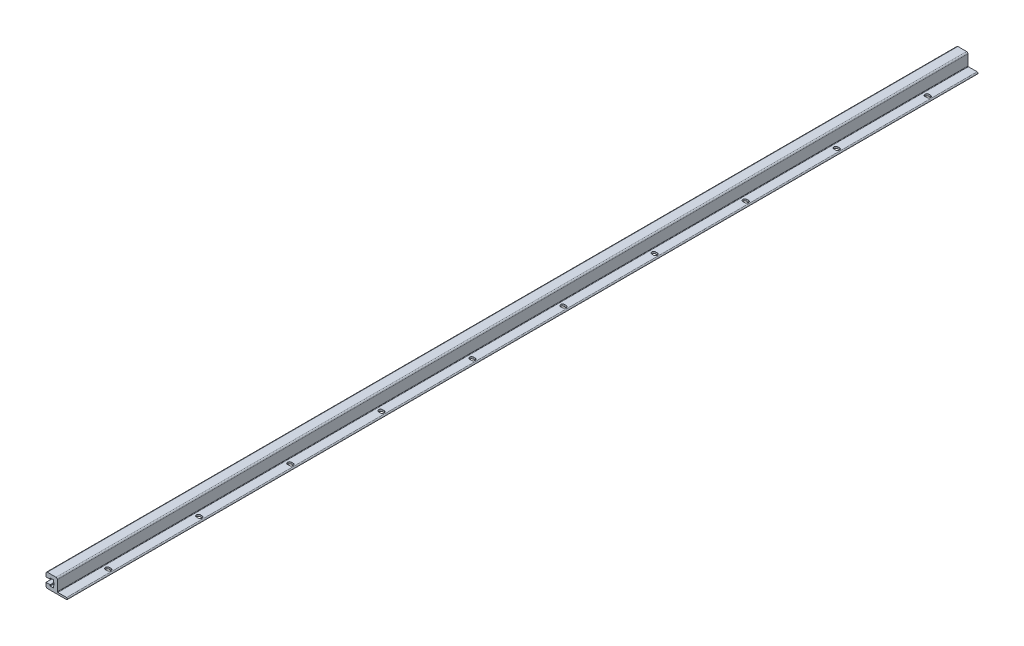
ISO-10303-21;
HEADER;
FILE_DESCRIPTION(('STEP AP214'),'2;1');
FILE_NAME('part.step','',(''),(''),'','','');
FILE_SCHEMA(('AUTOMOTIVE_DESIGN { 1 0 10303 214 1 1 1 1 }'));
ENDSEC;
DATA;
#1=APPLICATION_CONTEXT('core data for automotive mechanical design processes');
#2=APPLICATION_PROTOCOL_DEFINITION('international standard','automotive_design',2000,#1);
#3=PRODUCT_CONTEXT('',#1,'mechanical');
#4=PRODUCT('Part','Part','',(#3));
#5=PRODUCT_RELATED_PRODUCT_CATEGORY('part','',(#4));
#6=PRODUCT_DEFINITION_FORMATION('','',#4);
#7=PRODUCT_DEFINITION_CONTEXT('part definition',#1,'design');
#8=PRODUCT_DEFINITION('design','',#6,#7);
#9=PRODUCT_DEFINITION_SHAPE('','',#8);
#10=(LENGTH_UNIT() NAMED_UNIT(*) SI_UNIT(.MILLI.,.METRE.));
#11=(NAMED_UNIT(*) PLANE_ANGLE_UNIT() SI_UNIT($,.RADIAN.));
#12=(NAMED_UNIT(*) SI_UNIT($,.STERADIAN.) SOLID_ANGLE_UNIT());
#13=UNCERTAINTY_MEASURE_WITH_UNIT(LENGTH_MEASURE(1.E-05),#10,'distance_accuracy_value','');
#14=(GEOMETRIC_REPRESENTATION_CONTEXT(3) GLOBAL_UNCERTAINTY_ASSIGNED_CONTEXT((#13)) GLOBAL_UNIT_ASSIGNED_CONTEXT((#10,
#11,#12)) REPRESENTATION_CONTEXT('',''));
#15=CARTESIAN_POINT('',(0.,0.,0.));
#16=DIRECTION('',(0.,0.,1.));
#17=DIRECTION('',(1.,0.,0.));
#18=AXIS2_PLACEMENT_3D('',#15,#16,#17);
#19=CARTESIAN_POINT('',(3.69999999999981,7.75000000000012,0.));
#20=DIRECTION('',(-1.,0.,0.));
#21=DIRECTION('',(0.,0.,1.));
#22=AXIS2_PLACEMENT_3D('',#19,#20,#21);
#23=PLANE('',#22);
#24=DIRECTION('',(0.,0.,1.));
#25=VECTOR('',#24,1.);
#26=CARTESIAN_POINT('',(3.69999999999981,18.7,0.));
#27=LINE('',#26,#25);
#28=CARTESIAN_POINT('',(3.69999999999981,18.7,0.));
#29=VERTEX_POINT('',#28);
#30=CARTESIAN_POINT('',(3.69999999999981,18.7,2000.));
#31=VERTEX_POINT('',#30);
#32=EDGE_CURVE('E597',#29,#31,#27,.T.);
#33=ORIENTED_EDGE('',*,*,#32,.T.);
#34=DIRECTION('',(0.,-1.,0.));
#35=VECTOR('',#34,1.);
#36=CARTESIAN_POINT('',(3.69999999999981,7.75000000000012,2000.));
#37=LINE('',#36,#35);
#38=CARTESIAN_POINT('',(3.69999999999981,23.25,2000.));
#39=VERTEX_POINT('',#38);
#40=EDGE_CURVE('E540',#39,#31,#37,.T.);
#41=ORIENTED_EDGE('',*,*,#40,.F.);
#42=DIRECTION('',(0.,0.,1.));
#43=VECTOR('',#42,1.);
#44=CARTESIAN_POINT('',(3.69999999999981,23.25,0.));
#45=LINE('',#44,#43);
#46=CARTESIAN_POINT('',(3.69999999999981,23.25,0.));
#47=VERTEX_POINT('',#46);
#48=EDGE_CURVE('E494',#47,#39,#45,.T.);
#49=ORIENTED_EDGE('',*,*,#48,.F.);
#50=DIRECTION('',(0.,-1.,0.));
#51=VECTOR('',#50,1.);
#52=CARTESIAN_POINT('',(3.69999999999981,7.75000000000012,0.));
#53=LINE('',#52,#51);
#54=EDGE_CURVE('E428',#47,#29,#53,.T.);
#55=ORIENTED_EDGE('',*,*,#54,.T.);
#56=EDGE_LOOP('',(#33,#41,#49,#55));
#57=FACE_BOUND('',#56,.T.);
#58=ADVANCED_FACE('F14',(#57),#23,.T.);
#59=CARTESIAN_POINT('',(-9.5,28.,0.));
#60=DIRECTION('',(0.,0.,1.));
#61=DIRECTION('',(1.,0.,0.));
#62=AXIS2_PLACEMENT_3D('',#59,#60,#61);
#63=CYLINDRICAL_SURFACE('',#62,3.);
#64=CARTESIAN_POINT('',(-9.5,28.,2000.));
#65=DIRECTION('',(0.,0.,1.));
#66=DIRECTION('',(-1.,0.,0.));
#67=AXIS2_PLACEMENT_3D('',#64,#65,#66);
#68=CIRCLE('',#67,3.);
#69=CARTESIAN_POINT('',(-9.5,31.,2000.));
#70=VERTEX_POINT('',#69);
#71=CARTESIAN_POINT('',(-12.5,28.,2000.));
#72=VERTEX_POINT('',#71);
#73=EDGE_CURVE('E508',#70,#72,#68,.T.);
#74=ORIENTED_EDGE('',*,*,#73,.F.);
#75=DIRECTION('',(0.,0.,1.));
#76=VECTOR('',#75,1.);
#77=CARTESIAN_POINT('',(-9.5,31.,0.));
#78=LINE('',#77,#76);
#79=CARTESIAN_POINT('',(-9.5,31.,0.));
#80=VERTEX_POINT('',#79);
#81=EDGE_CURVE('E9',#80,#70,#78,.T.);
#82=ORIENTED_EDGE('',*,*,#81,.F.);
#83=CARTESIAN_POINT('',(-9.5,28.,0.));
#84=DIRECTION('',(0.,0.,1.));
#85=DIRECTION('',(-1.,0.,0.));
#86=AXIS2_PLACEMENT_3D('',#83,#84,#85);
#87=CIRCLE('',#86,3.);
#88=CARTESIAN_POINT('',(-12.5,28.,0.));
#89=VERTEX_POINT('',#88);
#90=EDGE_CURVE('E511',#80,#89,#87,.T.);
#91=ORIENTED_EDGE('',*,*,#90,.T.);
#92=DIRECTION('',(0.,0.,1.));
#93=VECTOR('',#92,1.);
#94=CARTESIAN_POINT('',(-12.5,28.,0.));
#95=LINE('',#94,#93);
#96=EDGE_CURVE('E18',#89,#72,#95,.T.);
#97=ORIENTED_EDGE('',*,*,#96,.T.);
#98=EDGE_LOOP('',(#74,#82,#91,#97));
#99=FACE_BOUND('',#98,.T.);
#100=ADVANCED_FACE('F16',(#99),#63,.T.);
#101=CARTESIAN_POINT('',(-9.5,31.,0.));
#102=DIRECTION('',(0.,1.,0.));
#103=DIRECTION('',(0.,0.,1.));
#104=AXIS2_PLACEMENT_3D('',#101,#102,#103);
#105=PLANE('',#104);
#106=DIRECTION('',(-1.,0.,0.));
#107=VECTOR('',#106,1.);
#108=CARTESIAN_POINT('',(-9.5,31.,2000.));
#109=LINE('',#108,#107);
#110=CARTESIAN_POINT('',(9.5,31.,2000.));
#111=VERTEX_POINT('',#110);
#112=EDGE_CURVE('E524',#111,#70,#109,.T.);
#113=ORIENTED_EDGE('',*,*,#112,.F.);
#114=DIRECTION('',(0.,0.,1.));
#115=VECTOR('',#114,1.);
#116=CARTESIAN_POINT('',(9.5,31.,0.));
#117=LINE('',#116,#115);
#118=CARTESIAN_POINT('',(9.5,31.,0.));
#119=VERTEX_POINT('',#118);
#120=EDGE_CURVE('E23',#119,#111,#117,.T.);
#121=ORIENTED_EDGE('',*,*,#120,.F.);
#122=DIRECTION('',(-1.,0.,0.));
#123=VECTOR('',#122,1.);
#124=CARTESIAN_POINT('',(-9.5,31.,0.));
#125=LINE('',#124,#123);
#126=EDGE_CURVE('E468',#119,#80,#125,.T.);
#127=ORIENTED_EDGE('',*,*,#126,.T.);
#128=ORIENTED_EDGE('',*,*,#81,.T.);
#129=EDGE_LOOP('',(#113,#121,#127,#128));
#130=FACE_BOUND('',#129,.T.);
#131=ADVANCED_FACE('F957',(#130),#105,.T.);
#132=CARTESIAN_POINT('',(9.5,28.,0.));
#133=DIRECTION('',(0.,0.,1.));
#134=DIRECTION('',(1.,0.,0.));
#135=AXIS2_PLACEMENT_3D('',#132,#133,#134);
#136=CYLINDRICAL_SURFACE('',#135,3.);
#137=CARTESIAN_POINT('',(9.5,28.,2000.));
#138=DIRECTION('',(0.,0.,1.));
#139=DIRECTION('',(1.,0.,0.));
#140=AXIS2_PLACEMENT_3D('',#137,#138,#139);
#141=CIRCLE('',#140,3.);
#142=CARTESIAN_POINT('',(12.5,28.,2000.));
#143=VERTEX_POINT('',#142);
#144=EDGE_CURVE('E572',#143,#111,#141,.T.);
#145=ORIENTED_EDGE('',*,*,#144,.F.);
#146=DIRECTION('',(0.,0.,1.));
#147=VECTOR('',#146,1.);
#148=CARTESIAN_POINT('',(12.5,28.,0.));
#149=LINE('',#148,#147);
#150=CARTESIAN_POINT('',(12.5,28.,0.));
#151=VERTEX_POINT('',#150);
#152=EDGE_CURVE('E472',#151,#143,#149,.T.);
#153=ORIENTED_EDGE('',*,*,#152,.F.);
#154=CARTESIAN_POINT('',(9.5,28.,0.));
#155=DIRECTION('',(0.,0.,1.));
#156=DIRECTION('',(1.,0.,0.));
#157=AXIS2_PLACEMENT_3D('',#154,#155,#156);
#158=CIRCLE('',#157,3.);
#159=EDGE_CURVE('E465',#151,#119,#158,.T.);
#160=ORIENTED_EDGE('',*,*,#159,.T.);
#161=ORIENTED_EDGE('',*,*,#120,.T.);
#162=EDGE_LOOP('',(#145,#153,#160,#161));
#163=FACE_BOUND('',#162,.T.);
#164=ADVANCED_FACE('F1006',(#163),#136,.T.);
#165=CARTESIAN_POINT('',(12.5,5.,0.));
#166=DIRECTION('',(1.,0.,0.));
#167=DIRECTION('',(0.,0.,-1.));
#168=AXIS2_PLACEMENT_3D('',#165,#166,#167);
#169=PLANE('',#168);
#170=DIRECTION('',(0.,1.,0.));
#171=VECTOR('',#170,1.);
#172=CARTESIAN_POINT('',(12.5,5.,2000.));
#173=LINE('',#172,#171);
#174=CARTESIAN_POINT('',(12.5,5.,2000.));
#175=VERTEX_POINT('',#174);
#176=EDGE_CURVE('E569',#175,#143,#173,.T.);
#177=ORIENTED_EDGE('',*,*,#176,.F.);
#178=DIRECTION('',(0.,0.,1.));
#179=VECTOR('',#178,1.);
#180=CARTESIAN_POINT('',(12.5,5.,0.));
#181=LINE('',#180,#179);
#182=CARTESIAN_POINT('',(12.5,5.,0.));
#183=VERTEX_POINT('',#182);
#184=EDGE_CURVE('E474',#183,#175,#181,.T.);
#185=ORIENTED_EDGE('',*,*,#184,.F.);
#186=DIRECTION('',(0.,1.,0.));
#187=VECTOR('',#186,1.);
#188=CARTESIAN_POINT('',(12.5,5.,0.));
#189=LINE('',#188,#187);
#190=EDGE_CURVE('E462',#183,#151,#189,.T.);
#191=ORIENTED_EDGE('',*,*,#190,.T.);
#192=ORIENTED_EDGE('',*,*,#152,.T.);
#193=EDGE_LOOP('',(#177,#185,#191,#192));
#194=FACE_BOUND('',#193,.T.);
#195=ADVANCED_FACE('F1002',(#194),#169,.T.);
#196=CARTESIAN_POINT('',(13.5,5.,0.));
#197=DIRECTION('',(0.,0.,1.));
#198=DIRECTION('',(1.,0.,0.));
#199=AXIS2_PLACEMENT_3D('',#196,#197,#198);
#200=CYLINDRICAL_SURFACE('',#199,1.);
#201=CARTESIAN_POINT('',(13.5,5.,2000.));
#202=DIRECTION('',(0.,0.,-1.));
#203=DIRECTION('',(1.,0.,0.));
#204=AXIS2_PLACEMENT_3D('',#201,#202,#203);
#205=CIRCLE('',#204,1.);
#206=CARTESIAN_POINT('',(13.5,4.,2000.));
#207=VERTEX_POINT('',#206);
#208=EDGE_CURVE('E566',#207,#175,#205,.T.);
#209=ORIENTED_EDGE('',*,*,#208,.F.);
#210=DIRECTION('',(0.,0.,1.));
#211=VECTOR('',#210,1.);
#212=CARTESIAN_POINT('',(13.5,4.,0.));
#213=LINE('',#212,#211);
#214=CARTESIAN_POINT('',(13.5,4.,0.));
#215=VERTEX_POINT('',#214);
#216=EDGE_CURVE('E476',#215,#207,#213,.T.);
#217=ORIENTED_EDGE('',*,*,#216,.F.);
#218=CARTESIAN_POINT('',(13.5,5.,0.));
#219=DIRECTION('',(0.,0.,-1.));
#220=DIRECTION('',(1.,0.,0.));
#221=AXIS2_PLACEMENT_3D('',#218,#219,#220);
#222=CIRCLE('',#221,1.);
#223=EDGE_CURVE('E459',#215,#183,#222,.T.);
#224=ORIENTED_EDGE('',*,*,#223,.T.);
#225=ORIENTED_EDGE('',*,*,#184,.T.);
#226=EDGE_LOOP('',(#209,#217,#224,#225));
#227=FACE_BOUND('',#226,.T.);
#228=ADVANCED_FACE('F998',(#227),#200,.F.);
#229=CARTESIAN_POINT('',(13.5,4.,0.));
#230=DIRECTION('',(0.,1.,0.));
#231=DIRECTION('',(0.,0.,1.));
#232=AXIS2_PLACEMENT_3D('',#229,#230,#231);
#233=PLANE('',#232);
#234=CARTESIAN_POINT('',(22.1999999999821,4.,100.));
#235=DIRECTION('',(0.,1.,0.));
#236=DIRECTION('',(0.,0.,1.));
#237=AXIS2_PLACEMENT_3D('',#234,#235,#236);
#238=CIRCLE('',#237,4.25);
#239=CARTESIAN_POINT('',(22.1999999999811,4.,95.75));
#240=VERTEX_POINT('',#239);
#241=CARTESIAN_POINT('',(22.1999999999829,4.,104.25));
#242=VERTEX_POINT('',#241);
#243=EDGE_CURVE('E39',#240,#242,#238,.T.);
#244=ORIENTED_EDGE('',*,*,#243,.F.);
#245=DIRECTION('',(-1.,0.,0.));
#246=VECTOR('',#245,1.);
#247=CARTESIAN_POINT('',(26.1999999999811,4.,95.75));
#248=LINE('',#247,#246);
#249=CARTESIAN_POINT('',(26.1999999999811,4.,95.75));
#250=VERTEX_POINT('',#249);
#251=EDGE_CURVE('E614',#250,#240,#248,.T.);
#252=ORIENTED_EDGE('',*,*,#251,.F.);
#253=CARTESIAN_POINT('',(26.1999999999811,4.,100.));
#254=DIRECTION('',(0.,1.,0.));
#255=DIRECTION('',(0.,0.,1.));
#256=AXIS2_PLACEMENT_3D('',#253,#254,#255);
#257=CIRCLE('',#256,4.25);
#258=CARTESIAN_POINT('',(26.1999999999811,4.,104.25));
#259=VERTEX_POINT('',#258);
#260=EDGE_CURVE('E611',#259,#250,#257,.T.);
#261=ORIENTED_EDGE('',*,*,#260,.F.);
#262=DIRECTION('',(1.,0.,0.));
#263=VECTOR('',#262,1.);
#264=CARTESIAN_POINT('',(26.1999999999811,4.,104.25));
#265=LINE('',#264,#263);
#266=EDGE_CURVE('E602',#242,#259,#265,.T.);
#267=ORIENTED_EDGE('',*,*,#266,.F.);
#268=EDGE_LOOP('',(#244,#252,#261,#267));
#269=FACE_BOUND('',#268,.T.);
#270=CARTESIAN_POINT('',(22.1999999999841,4.,300.));
#271=DIRECTION('',(0.,1.,0.));
#272=DIRECTION('',(0.,0.,1.));
#273=AXIS2_PLACEMENT_3D('',#270,#271,#272);
#274=CIRCLE('',#273,4.25);
#275=CARTESIAN_POINT('',(22.1999999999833,4.,295.75));
#276=VERTEX_POINT('',#275);
#277=CARTESIAN_POINT('',(22.199999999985,4.,304.25));
#278=VERTEX_POINT('',#277);
#279=EDGE_CURVE('E632',#276,#278,#274,.T.);
#280=ORIENTED_EDGE('',*,*,#279,.F.);
#281=DIRECTION('',(-1.,0.,0.));
#282=VECTOR('',#281,1.);
#283=CARTESIAN_POINT('',(26.1999999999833,4.,295.75));
#284=LINE('',#283,#282);
#285=CARTESIAN_POINT('',(26.1999999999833,4.,295.75));
#286=VERTEX_POINT('',#285);
#287=EDGE_CURVE('E645',#286,#276,#284,.T.);
#288=ORIENTED_EDGE('',*,*,#287,.F.);
#289=CARTESIAN_POINT('',(26.1999999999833,4.,300.));
#290=DIRECTION('',(0.,1.,0.));
#291=DIRECTION('',(0.,0.,1.));
#292=AXIS2_PLACEMENT_3D('',#289,#290,#291);
#293=CIRCLE('',#292,4.25);
#294=CARTESIAN_POINT('',(26.1999999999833,4.,304.25));
#295=VERTEX_POINT('',#294);
#296=EDGE_CURVE('E642',#295,#286,#293,.T.);
#297=ORIENTED_EDGE('',*,*,#296,.F.);
#298=DIRECTION('',(1.,0.,0.));
#299=VECTOR('',#298,1.);
#300=CARTESIAN_POINT('',(26.1999999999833,4.,304.25));
#301=LINE('',#300,#299);
#302=EDGE_CURVE('E639',#278,#295,#301,.T.);
#303=ORIENTED_EDGE('',*,*,#302,.F.);
#304=EDGE_LOOP('',(#280,#288,#297,#303));
#305=FACE_BOUND('',#304,.T.);
#306=CARTESIAN_POINT('',(22.1999999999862,4.,500.));
#307=DIRECTION('',(0.,1.,0.));
#308=DIRECTION('',(0.,0.,1.));
#309=AXIS2_PLACEMENT_3D('',#306,#307,#308);
#310=CIRCLE('',#309,4.25);
#311=CARTESIAN_POINT('',(22.1999999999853,4.,495.75));
#312=VERTEX_POINT('',#311);
#313=CARTESIAN_POINT('',(22.1999999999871,4.,504.25));
#314=VERTEX_POINT('',#313);
#315=EDGE_CURVE('E663',#312,#314,#310,.T.);
#316=ORIENTED_EDGE('',*,*,#315,.F.);
#317=DIRECTION('',(-1.,0.,0.));
#318=VECTOR('',#317,1.);
#319=CARTESIAN_POINT('',(26.1999999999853,4.,495.75));
#320=LINE('',#319,#318);
#321=CARTESIAN_POINT('',(26.1999999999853,4.,495.75));
#322=VERTEX_POINT('',#321);
#323=EDGE_CURVE('E677',#322,#312,#320,.T.);
#324=ORIENTED_EDGE('',*,*,#323,.F.);
#325=CARTESIAN_POINT('',(26.1999999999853,4.,500.));
#326=DIRECTION('',(0.,1.,0.));
#327=DIRECTION('',(0.,0.,1.));
#328=AXIS2_PLACEMENT_3D('',#325,#326,#327);
#329=CIRCLE('',#328,4.25);
#330=CARTESIAN_POINT('',(26.1999999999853,4.,504.25));
#331=VERTEX_POINT('',#330);
#332=EDGE_CURVE('E674',#331,#322,#329,.T.);
#333=ORIENTED_EDGE('',*,*,#332,.F.);
#334=DIRECTION('',(1.,0.,0.));
#335=VECTOR('',#334,1.);
#336=CARTESIAN_POINT('',(26.1999999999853,4.,504.25));
#337=LINE('',#336,#335);
#338=EDGE_CURVE('E671',#314,#331,#337,.T.);
#339=ORIENTED_EDGE('',*,*,#338,.F.);
#340=EDGE_LOOP('',(#316,#324,#333,#339));
#341=FACE_BOUND('',#340,.T.);
#342=CARTESIAN_POINT('',(22.1999999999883,4.,700.));
#343=DIRECTION('',(0.,1.,0.));
#344=DIRECTION('',(0.,0.,1.));
#345=AXIS2_PLACEMENT_3D('',#342,#343,#344);
#346=CIRCLE('',#345,4.25);
#347=CARTESIAN_POINT('',(22.1999999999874,4.,695.75));
#348=VERTEX_POINT('',#347);
#349=CARTESIAN_POINT('',(22.1999999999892,4.,704.25));
#350=VERTEX_POINT('',#349);
#351=EDGE_CURVE('E695',#348,#350,#346,.T.);
#352=ORIENTED_EDGE('',*,*,#351,.F.);
#353=DIRECTION('',(-1.,0.,0.));
#354=VECTOR('',#353,1.);
#355=CARTESIAN_POINT('',(26.1999999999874,4.,695.75));
#356=LINE('',#355,#354);
#357=CARTESIAN_POINT('',(26.1999999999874,4.,695.75));
#358=VERTEX_POINT('',#357);
#359=EDGE_CURVE('E709',#358,#348,#356,.T.);
#360=ORIENTED_EDGE('',*,*,#359,.F.);
#361=CARTESIAN_POINT('',(26.1999999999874,4.,700.));
#362=DIRECTION('',(0.,1.,0.));
#363=DIRECTION('',(0.,0.,1.));
#364=AXIS2_PLACEMENT_3D('',#361,#362,#363);
#365=CIRCLE('',#364,4.25);
#366=CARTESIAN_POINT('',(26.1999999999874,4.,704.25));
#367=VERTEX_POINT('',#366);
#368=EDGE_CURVE('E706',#367,#358,#365,.T.);
#369=ORIENTED_EDGE('',*,*,#368,.F.);
#370=DIRECTION('',(1.,0.,0.));
#371=VECTOR('',#370,1.);
#372=CARTESIAN_POINT('',(26.1999999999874,4.,704.25));
#373=LINE('',#372,#371);
#374=EDGE_CURVE('E703',#350,#367,#373,.T.);
#375=ORIENTED_EDGE('',*,*,#374,.F.);
#376=EDGE_LOOP('',(#352,#360,#369,#375));
#377=FACE_BOUND('',#376,.T.);
#378=CARTESIAN_POINT('',(22.1999999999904,4.,900.));
#379=DIRECTION('',(0.,1.,0.));
#380=DIRECTION('',(0.,0.,1.));
#381=AXIS2_PLACEMENT_3D('',#378,#379,#380);
#382=CIRCLE('',#381,4.25);
#383=CARTESIAN_POINT('',(22.1999999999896,4.,895.75));
#384=VERTEX_POINT('',#383);
#385=CARTESIAN_POINT('',(22.1999999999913,4.,904.25));
#386=VERTEX_POINT('',#385);
#387=EDGE_CURVE('E727',#384,#386,#382,.T.);
#388=ORIENTED_EDGE('',*,*,#387,.F.);
#389=DIRECTION('',(-1.,0.,0.));
#390=VECTOR('',#389,1.);
#391=CARTESIAN_POINT('',(26.1999999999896,4.,895.75));
#392=LINE('',#391,#390);
#393=CARTESIAN_POINT('',(26.1999999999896,4.,895.75));
#394=VERTEX_POINT('',#393);
#395=EDGE_CURVE('E741',#394,#384,#392,.T.);
#396=ORIENTED_EDGE('',*,*,#395,.F.);
#397=CARTESIAN_POINT('',(26.1999999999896,4.,900.));
#398=DIRECTION('',(0.,1.,0.));
#399=DIRECTION('',(0.,0.,1.));
#400=AXIS2_PLACEMENT_3D('',#397,#398,#399);
#401=CIRCLE('',#400,4.25);
#402=CARTESIAN_POINT('',(26.1999999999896,4.,904.25));
#403=VERTEX_POINT('',#402);
#404=EDGE_CURVE('E738',#403,#394,#401,.T.);
#405=ORIENTED_EDGE('',*,*,#404,.F.);
#406=DIRECTION('',(1.,0.,0.));
#407=VECTOR('',#406,1.);
#408=CARTESIAN_POINT('',(26.1999999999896,4.,904.25));
#409=LINE('',#408,#407);
#410=EDGE_CURVE('E735',#386,#403,#409,.T.);
#411=ORIENTED_EDGE('',*,*,#410,.F.);
#412=EDGE_LOOP('',(#388,#396,#405,#411));
#413=FACE_BOUND('',#412,.T.);
#414=CARTESIAN_POINT('',(22.1999999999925,4.,1100.));
#415=DIRECTION('',(0.,1.,0.));
#416=DIRECTION('',(0.,0.,1.));
#417=AXIS2_PLACEMENT_3D('',#414,#415,#416);
#418=CIRCLE('',#417,4.25);
#419=CARTESIAN_POINT('',(22.1999999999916,4.,1095.75));
#420=VERTEX_POINT('',#419);
#421=CARTESIAN_POINT('',(22.1999999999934,4.,1104.25));
#422=VERTEX_POINT('',#421);
#423=EDGE_CURVE('E759',#420,#422,#418,.T.);
#424=ORIENTED_EDGE('',*,*,#423,.F.);
#425=DIRECTION('',(-1.,0.,0.));
#426=VECTOR('',#425,1.);
#427=CARTESIAN_POINT('',(26.1999999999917,4.,1095.75));
#428=LINE('',#427,#426);
#429=CARTESIAN_POINT('',(26.1999999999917,4.,1095.75));
#430=VERTEX_POINT('',#429);
#431=EDGE_CURVE('E773',#430,#420,#428,.T.);
#432=ORIENTED_EDGE('',*,*,#431,.F.);
#433=CARTESIAN_POINT('',(26.1999999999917,4.,1100.));
#434=DIRECTION('',(0.,1.,0.));
#435=DIRECTION('',(0.,0.,1.));
#436=AXIS2_PLACEMENT_3D('',#433,#434,#435);
#437=CIRCLE('',#436,4.25);
#438=CARTESIAN_POINT('',(26.1999999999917,4.,1104.25));
#439=VERTEX_POINT('',#438);
#440=EDGE_CURVE('E770',#439,#430,#437,.T.);
#441=ORIENTED_EDGE('',*,*,#440,.F.);
#442=DIRECTION('',(1.,0.,0.));
#443=VECTOR('',#442,1.);
#444=CARTESIAN_POINT('',(26.1999999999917,4.,1104.25));
#445=LINE('',#444,#443);
#446=EDGE_CURVE('E767',#422,#439,#445,.T.);
#447=ORIENTED_EDGE('',*,*,#446,.F.);
#448=EDGE_LOOP('',(#424,#432,#441,#447));
#449=FACE_BOUND('',#448,.T.);
#450=CARTESIAN_POINT('',(22.1999999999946,4.,1300.));
#451=DIRECTION('',(0.,1.,0.));
#452=DIRECTION('',(0.,0.,1.));
#453=AXIS2_PLACEMENT_3D('',#450,#451,#452);
#454=CIRCLE('',#453,4.25);
#455=CARTESIAN_POINT('',(22.1999999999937,4.,1295.75));
#456=VERTEX_POINT('',#455);
#457=CARTESIAN_POINT('',(22.1999999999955,4.,1304.25));
#458=VERTEX_POINT('',#457);
#459=EDGE_CURVE('E791',#456,#458,#454,.T.);
#460=ORIENTED_EDGE('',*,*,#459,.F.);
#461=DIRECTION('',(-1.,0.,0.));
#462=VECTOR('',#461,1.);
#463=CARTESIAN_POINT('',(26.1999999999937,4.,1295.75));
#464=LINE('',#463,#462);
#465=CARTESIAN_POINT('',(26.1999999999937,4.,1295.75));
#466=VERTEX_POINT('',#465);
#467=EDGE_CURVE('E805',#466,#456,#464,.T.);
#468=ORIENTED_EDGE('',*,*,#467,.F.);
#469=CARTESIAN_POINT('',(26.1999999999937,4.,1300.));
#470=DIRECTION('',(0.,1.,0.));
#471=DIRECTION('',(0.,0.,1.));
#472=AXIS2_PLACEMENT_3D('',#469,#470,#471);
#473=CIRCLE('',#472,4.25);
#474=CARTESIAN_POINT('',(26.1999999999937,4.,1304.25));
#475=VERTEX_POINT('',#474);
#476=EDGE_CURVE('E802',#475,#466,#473,.T.);
#477=ORIENTED_EDGE('',*,*,#476,.F.);
#478=DIRECTION('',(1.,0.,0.));
#479=VECTOR('',#478,1.);
#480=CARTESIAN_POINT('',(26.1999999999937,4.,1304.25));
#481=LINE('',#480,#479);
#482=EDGE_CURVE('E799',#458,#475,#481,.T.);
#483=ORIENTED_EDGE('',*,*,#482,.F.);
#484=EDGE_LOOP('',(#460,#468,#477,#483));
#485=FACE_BOUND('',#484,.T.);
#486=CARTESIAN_POINT('',(22.1999999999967,4.,1500.));
#487=DIRECTION('',(0.,1.,0.));
#488=DIRECTION('',(0.,0.,1.));
#489=AXIS2_PLACEMENT_3D('',#486,#487,#488);
#490=CIRCLE('',#489,4.25);
#491=CARTESIAN_POINT('',(22.1999999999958,4.,1495.75));
#492=VERTEX_POINT('',#491);
#493=CARTESIAN_POINT('',(22.1999999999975,4.,1504.25));
#494=VERTEX_POINT('',#493);
#495=EDGE_CURVE('E823',#492,#494,#490,.T.);
#496=ORIENTED_EDGE('',*,*,#495,.F.);
#497=DIRECTION('',(-1.,0.,0.));
#498=VECTOR('',#497,1.);
#499=CARTESIAN_POINT('',(26.1999999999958,4.,1495.75));
#500=LINE('',#499,#498);
#501=CARTESIAN_POINT('',(26.1999999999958,4.,1495.75));
#502=VERTEX_POINT('',#501);
#503=EDGE_CURVE('E837',#502,#492,#500,.T.);
#504=ORIENTED_EDGE('',*,*,#503,.F.);
#505=CARTESIAN_POINT('',(26.1999999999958,4.,1500.));
#506=DIRECTION('',(0.,1.,0.));
#507=DIRECTION('',(0.,0.,1.));
#508=AXIS2_PLACEMENT_3D('',#505,#506,#507);
#509=CIRCLE('',#508,4.25);
#510=CARTESIAN_POINT('',(26.1999999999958,4.,1504.25));
#511=VERTEX_POINT('',#510);
#512=EDGE_CURVE('E834',#511,#502,#509,.T.);
#513=ORIENTED_EDGE('',*,*,#512,.F.);
#514=DIRECTION('',(1.,0.,0.));
#515=VECTOR('',#514,1.);
#516=CARTESIAN_POINT('',(26.1999999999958,4.,1504.25));
#517=LINE('',#516,#515);
#518=EDGE_CURVE('E831',#494,#511,#517,.T.);
#519=ORIENTED_EDGE('',*,*,#518,.F.);
#520=EDGE_LOOP('',(#496,#504,#513,#519));
#521=FACE_BOUND('',#520,.T.);
#522=CARTESIAN_POINT('',(22.1999999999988,4.,1700.));
#523=DIRECTION('',(0.,1.,0.));
#524=DIRECTION('',(0.,0.,1.));
#525=AXIS2_PLACEMENT_3D('',#522,#523,#524);
#526=CIRCLE('',#525,4.25);
#527=CARTESIAN_POINT('',(22.1999999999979,4.,1695.75));
#528=VERTEX_POINT('',#527);
#529=CARTESIAN_POINT('',(22.1999999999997,4.,1704.25));
#530=VERTEX_POINT('',#529);
#531=EDGE_CURVE('E855',#528,#530,#526,.T.);
#532=ORIENTED_EDGE('',*,*,#531,.F.);
#533=DIRECTION('',(-1.,0.,0.));
#534=VECTOR('',#533,1.);
#535=CARTESIAN_POINT('',(26.1999999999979,4.,1695.75));
#536=LINE('',#535,#534);
#537=CARTESIAN_POINT('',(26.1999999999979,4.,1695.75));
#538=VERTEX_POINT('',#537);
#539=EDGE_CURVE('E869',#538,#528,#536,.T.);
#540=ORIENTED_EDGE('',*,*,#539,.F.);
#541=CARTESIAN_POINT('',(26.1999999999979,4.,1700.));
#542=DIRECTION('',(0.,1.,0.));
#543=DIRECTION('',(0.,0.,1.));
#544=AXIS2_PLACEMENT_3D('',#541,#542,#543);
#545=CIRCLE('',#544,4.25);
#546=CARTESIAN_POINT('',(26.1999999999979,4.,1704.25));
#547=VERTEX_POINT('',#546);
#548=EDGE_CURVE('E866',#547,#538,#545,.T.);
#549=ORIENTED_EDGE('',*,*,#548,.F.);
#550=DIRECTION('',(1.,0.,0.));
#551=VECTOR('',#550,1.);
#552=CARTESIAN_POINT('',(26.1999999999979,4.,1704.25));
#553=LINE('',#552,#551);
#554=EDGE_CURVE('E863',#530,#547,#553,.T.);
#555=ORIENTED_EDGE('',*,*,#554,.F.);
#556=EDGE_LOOP('',(#532,#540,#549,#555));
#557=FACE_BOUND('',#556,.T.);
#558=CARTESIAN_POINT('',(22.2000000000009,4.,1900.));
#559=DIRECTION('',(0.,1.,0.));
#560=DIRECTION('',(0.,0.,1.));
#561=AXIS2_PLACEMENT_3D('',#558,#559,#560);
#562=CIRCLE('',#561,4.25);
#563=CARTESIAN_POINT('',(22.2,4.,1895.75));
#564=VERTEX_POINT('',#563);
#565=CARTESIAN_POINT('',(22.2000000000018,4.,1904.25));
#566=VERTEX_POINT('',#565);
#567=EDGE_CURVE('E887',#564,#566,#562,.T.);
#568=ORIENTED_EDGE('',*,*,#567,.F.);
#569=DIRECTION('',(-1.,0.,0.));
#570=VECTOR('',#569,1.);
#571=CARTESIAN_POINT('',(26.2,4.,1895.75));
#572=LINE('',#571,#570);
#573=CARTESIAN_POINT('',(26.2,4.,1895.75));
#574=VERTEX_POINT('',#573);
#575=EDGE_CURVE('E901',#574,#564,#572,.T.);
#576=ORIENTED_EDGE('',*,*,#575,.F.);
#577=CARTESIAN_POINT('',(26.2,4.,1900.));
#578=DIRECTION('',(0.,1.,0.));
#579=DIRECTION('',(0.,0.,1.));
#580=AXIS2_PLACEMENT_3D('',#577,#578,#579);
#581=CIRCLE('',#580,4.25);
#582=CARTESIAN_POINT('',(26.2,4.,1904.25));
#583=VERTEX_POINT('',#582);
#584=EDGE_CURVE('E898',#583,#574,#581,.T.);
#585=ORIENTED_EDGE('',*,*,#584,.F.);
#586=DIRECTION('',(1.,0.,0.));
#587=VECTOR('',#586,1.);
#588=CARTESIAN_POINT('',(26.2,4.,1904.25));
#589=LINE('',#588,#587);
#590=EDGE_CURVE('E895',#566,#583,#589,.T.);
#591=ORIENTED_EDGE('',*,*,#590,.F.);
#592=EDGE_LOOP('',(#568,#576,#585,#591));
#593=FACE_BOUND('',#592,.T.);
#594=DIRECTION('',(-1.,0.,0.));
#595=VECTOR('',#594,1.);
#596=CARTESIAN_POINT('',(13.5,4.,2000.));
#597=LINE('',#596,#595);
#598=CARTESIAN_POINT('',(32.5,4.,2000.));
#599=VERTEX_POINT('',#598);
#600=EDGE_CURVE('E563',#599,#207,#597,.T.);
#601=ORIENTED_EDGE('',*,*,#600,.F.);
#602=DIRECTION('',(0.,0.,1.));
#603=VECTOR('',#602,1.);
#604=CARTESIAN_POINT('',(32.5,4.,0.));
#605=LINE('',#604,#603);
#606=CARTESIAN_POINT('',(32.5,4.,0.));
#607=VERTEX_POINT('',#606);
#608=EDGE_CURVE('E478',#607,#599,#605,.T.);
#609=ORIENTED_EDGE('',*,*,#608,.F.);
#610=DIRECTION('',(-1.,0.,0.));
#611=VECTOR('',#610,1.);
#612=CARTESIAN_POINT('',(13.5,4.,0.));
#613=LINE('',#612,#611);
#614=EDGE_CURVE('E456',#607,#215,#613,.T.);
#615=ORIENTED_EDGE('',*,*,#614,.T.);
#616=ORIENTED_EDGE('',*,*,#216,.T.);
#617=EDGE_LOOP('',(#601,#609,#615,#616));
#618=FACE_BOUND('',#617,.T.);
#619=ADVANCED_FACE('F929',(#269,#305,#341,#377,#413,#449,#485,#521,#557,#593,#618),#233,.T.);
#620=CARTESIAN_POINT('',(32.5,2.,0.));
#621=DIRECTION('',(0.,0.,1.));
#622=DIRECTION('',(1.,0.,0.));
#623=AXIS2_PLACEMENT_3D('',#620,#621,#622);
#624=CYLINDRICAL_SURFACE('',#623,2.);
#625=CARTESIAN_POINT('',(32.5,2.,2000.));
#626=DIRECTION('',(0.,0.,1.));
#627=DIRECTION('',(1.,0.,0.));
#628=AXIS2_PLACEMENT_3D('',#625,#626,#627);
#629=CIRCLE('',#628,2.);
#630=CARTESIAN_POINT('',(32.5,0.,2000.));
#631=VERTEX_POINT('',#630);
#632=EDGE_CURVE('E560',#631,#599,#629,.T.);
#633=ORIENTED_EDGE('',*,*,#632,.F.);
#634=DIRECTION('',(0.,0.,1.));
#635=VECTOR('',#634,1.);
#636=CARTESIAN_POINT('',(32.5,0.,0.));
#637=LINE('',#636,#635);
#638=CARTESIAN_POINT('',(32.5,0.,0.));
#639=VERTEX_POINT('',#638);
#640=EDGE_CURVE('E480',#639,#631,#637,.T.);
#641=ORIENTED_EDGE('',*,*,#640,.F.);
#642=CARTESIAN_POINT('',(32.5,2.,0.));
#643=DIRECTION('',(0.,0.,1.));
#644=DIRECTION('',(1.,0.,0.));
#645=AXIS2_PLACEMENT_3D('',#642,#643,#644);
#646=CIRCLE('',#645,2.);
#647=EDGE_CURVE('E453',#639,#607,#646,.T.);
#648=ORIENTED_EDGE('',*,*,#647,.T.);
#649=ORIENTED_EDGE('',*,*,#608,.T.);
#650=EDGE_LOOP('',(#633,#641,#648,#649));
#651=FACE_BOUND('',#650,.T.);
#652=ADVANCED_FACE('F991',(#651),#624,.T.);
#653=CARTESIAN_POINT('',(-9.5,0.,0.));
#654=DIRECTION('',(0.,-1.,0.));
#655=DIRECTION('',(0.,0.,-1.));
#656=AXIS2_PLACEMENT_3D('',#653,#654,#655);
#657=PLANE('',#656);
#658=CARTESIAN_POINT('',(22.1999999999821,0.,100.));
#659=DIRECTION('',(0.,1.,0.));
#660=DIRECTION('',(0.,0.,1.));
#661=AXIS2_PLACEMENT_3D('',#658,#659,#660);
#662=CIRCLE('',#661,4.25);
#663=CARTESIAN_POINT('',(22.1999999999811,0.,95.75));
#664=VERTEX_POINT('',#663);
#665=CARTESIAN_POINT('',(22.1999999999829,0.,104.25));
#666=VERTEX_POINT('',#665);
#667=EDGE_CURVE('E617',#664,#666,#662,.T.);
#668=ORIENTED_EDGE('',*,*,#667,.T.);
#669=DIRECTION('',(1.,0.,0.));
#670=VECTOR('',#669,1.);
#671=CARTESIAN_POINT('',(26.1999999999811,0.,104.25));
#672=LINE('',#671,#670);
#673=CARTESIAN_POINT('',(26.1999999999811,0.,104.25));
#674=VERTEX_POINT('',#673);
#675=EDGE_CURVE('E620',#666,#674,#672,.T.);
#676=ORIENTED_EDGE('',*,*,#675,.T.);
#677=CARTESIAN_POINT('',(26.1999999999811,0.,100.));
#678=DIRECTION('',(0.,1.,0.));
#679=DIRECTION('',(0.,0.,1.));
#680=AXIS2_PLACEMENT_3D('',#677,#678,#679);
#681=CIRCLE('',#680,4.25);
#682=CARTESIAN_POINT('',(26.1999999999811,0.,95.75));
#683=VERTEX_POINT('',#682);
#684=EDGE_CURVE('E623',#674,#683,#681,.T.);
#685=ORIENTED_EDGE('',*,*,#684,.T.);
#686=DIRECTION('',(-1.,0.,0.));
#687=VECTOR('',#686,1.);
#688=CARTESIAN_POINT('',(26.1999999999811,0.,95.75));
#689=LINE('',#688,#687);
#690=EDGE_CURVE('E626',#683,#664,#689,.T.);
#691=ORIENTED_EDGE('',*,*,#690,.T.);
#692=EDGE_LOOP('',(#668,#676,#685,#691));
#693=FACE_BOUND('',#692,.T.);
#694=CARTESIAN_POINT('',(22.1999999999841,0.,300.));
#695=DIRECTION('',(0.,1.,0.));
#696=DIRECTION('',(0.,0.,1.));
#697=AXIS2_PLACEMENT_3D('',#694,#695,#696);
#698=CIRCLE('',#697,4.25);
#699=CARTESIAN_POINT('',(22.1999999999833,0.,295.75));
#700=VERTEX_POINT('',#699);
#701=CARTESIAN_POINT('',(22.199999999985,0.,304.25));
#702=VERTEX_POINT('',#701);
#703=EDGE_CURVE('E648',#700,#702,#698,.T.);
#704=ORIENTED_EDGE('',*,*,#703,.T.);
#705=DIRECTION('',(1.,0.,0.));
#706=VECTOR('',#705,1.);
#707=CARTESIAN_POINT('',(26.1999999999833,0.,304.25));
#708=LINE('',#707,#706);
#709=CARTESIAN_POINT('',(26.1999999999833,0.,304.25));
#710=VERTEX_POINT('',#709);
#711=EDGE_CURVE('E651',#702,#710,#708,.T.);
#712=ORIENTED_EDGE('',*,*,#711,.T.);
#713=CARTESIAN_POINT('',(26.1999999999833,0.,300.));
#714=DIRECTION('',(0.,1.,0.));
#715=DIRECTION('',(0.,0.,1.));
#716=AXIS2_PLACEMENT_3D('',#713,#714,#715);
#717=CIRCLE('',#716,4.25);
#718=CARTESIAN_POINT('',(26.1999999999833,0.,295.75));
#719=VERTEX_POINT('',#718);
#720=EDGE_CURVE('E654',#710,#719,#717,.T.);
#721=ORIENTED_EDGE('',*,*,#720,.T.);
#722=DIRECTION('',(-1.,0.,0.));
#723=VECTOR('',#722,1.);
#724=CARTESIAN_POINT('',(26.1999999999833,0.,295.75));
#725=LINE('',#724,#723);
#726=EDGE_CURVE('E657',#719,#700,#725,.T.);
#727=ORIENTED_EDGE('',*,*,#726,.T.);
#728=EDGE_LOOP('',(#704,#712,#721,#727));
#729=FACE_BOUND('',#728,.T.);
#730=CARTESIAN_POINT('',(22.1999999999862,0.,500.));
#731=DIRECTION('',(0.,1.,0.));
#732=DIRECTION('',(0.,0.,1.));
#733=AXIS2_PLACEMENT_3D('',#730,#731,#732);
#734=CIRCLE('',#733,4.25);
#735=CARTESIAN_POINT('',(22.1999999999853,0.,495.75));
#736=VERTEX_POINT('',#735);
#737=CARTESIAN_POINT('',(22.1999999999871,0.,504.25));
#738=VERTEX_POINT('',#737);
#739=EDGE_CURVE('E680',#736,#738,#734,.T.);
#740=ORIENTED_EDGE('',*,*,#739,.T.);
#741=DIRECTION('',(1.,0.,0.));
#742=VECTOR('',#741,1.);
#743=CARTESIAN_POINT('',(26.1999999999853,0.,504.25));
#744=LINE('',#743,#742);
#745=CARTESIAN_POINT('',(26.1999999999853,0.,504.25));
#746=VERTEX_POINT('',#745);
#747=EDGE_CURVE('E683',#738,#746,#744,.T.);
#748=ORIENTED_EDGE('',*,*,#747,.T.);
#749=CARTESIAN_POINT('',(26.1999999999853,0.,500.));
#750=DIRECTION('',(0.,1.,0.));
#751=DIRECTION('',(0.,0.,1.));
#752=AXIS2_PLACEMENT_3D('',#749,#750,#751);
#753=CIRCLE('',#752,4.25);
#754=CARTESIAN_POINT('',(26.1999999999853,0.,495.75));
#755=VERTEX_POINT('',#754);
#756=EDGE_CURVE('E686',#746,#755,#753,.T.);
#757=ORIENTED_EDGE('',*,*,#756,.T.);
#758=DIRECTION('',(-1.,0.,0.));
#759=VECTOR('',#758,1.);
#760=CARTESIAN_POINT('',(26.1999999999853,0.,495.75));
#761=LINE('',#760,#759);
#762=EDGE_CURVE('E689',#755,#736,#761,.T.);
#763=ORIENTED_EDGE('',*,*,#762,.T.);
#764=EDGE_LOOP('',(#740,#748,#757,#763));
#765=FACE_BOUND('',#764,.T.);
#766=CARTESIAN_POINT('',(22.1999999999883,0.,700.));
#767=DIRECTION('',(0.,1.,0.));
#768=DIRECTION('',(0.,0.,1.));
#769=AXIS2_PLACEMENT_3D('',#766,#767,#768);
#770=CIRCLE('',#769,4.25);
#771=CARTESIAN_POINT('',(22.1999999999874,0.,695.75));
#772=VERTEX_POINT('',#771);
#773=CARTESIAN_POINT('',(22.1999999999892,0.,704.25));
#774=VERTEX_POINT('',#773);
#775=EDGE_CURVE('E712',#772,#774,#770,.T.);
#776=ORIENTED_EDGE('',*,*,#775,.T.);
#777=DIRECTION('',(1.,0.,0.));
#778=VECTOR('',#777,1.);
#779=CARTESIAN_POINT('',(26.1999999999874,0.,704.25));
#780=LINE('',#779,#778);
#781=CARTESIAN_POINT('',(26.1999999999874,0.,704.25));
#782=VERTEX_POINT('',#781);
#783=EDGE_CURVE('E715',#774,#782,#780,.T.);
#784=ORIENTED_EDGE('',*,*,#783,.T.);
#785=CARTESIAN_POINT('',(26.1999999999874,0.,700.));
#786=DIRECTION('',(0.,1.,0.));
#787=DIRECTION('',(0.,0.,1.));
#788=AXIS2_PLACEMENT_3D('',#785,#786,#787);
#789=CIRCLE('',#788,4.25);
#790=CARTESIAN_POINT('',(26.1999999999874,0.,695.75));
#791=VERTEX_POINT('',#790);
#792=EDGE_CURVE('E718',#782,#791,#789,.T.);
#793=ORIENTED_EDGE('',*,*,#792,.T.);
#794=DIRECTION('',(-1.,0.,0.));
#795=VECTOR('',#794,1.);
#796=CARTESIAN_POINT('',(26.1999999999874,0.,695.75));
#797=LINE('',#796,#795);
#798=EDGE_CURVE('E721',#791,#772,#797,.T.);
#799=ORIENTED_EDGE('',*,*,#798,.T.);
#800=EDGE_LOOP('',(#776,#784,#793,#799));
#801=FACE_BOUND('',#800,.T.);
#802=CARTESIAN_POINT('',(22.1999999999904,0.,900.));
#803=DIRECTION('',(0.,1.,0.));
#804=DIRECTION('',(0.,0.,1.));
#805=AXIS2_PLACEMENT_3D('',#802,#803,#804);
#806=CIRCLE('',#805,4.25);
#807=CARTESIAN_POINT('',(22.1999999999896,0.,895.75));
#808=VERTEX_POINT('',#807);
#809=CARTESIAN_POINT('',(22.1999999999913,0.,904.25));
#810=VERTEX_POINT('',#809);
#811=EDGE_CURVE('E744',#808,#810,#806,.T.);
#812=ORIENTED_EDGE('',*,*,#811,.T.);
#813=DIRECTION('',(1.,0.,0.));
#814=VECTOR('',#813,1.);
#815=CARTESIAN_POINT('',(26.1999999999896,0.,904.25));
#816=LINE('',#815,#814);
#817=CARTESIAN_POINT('',(26.1999999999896,0.,904.25));
#818=VERTEX_POINT('',#817);
#819=EDGE_CURVE('E747',#810,#818,#816,.T.);
#820=ORIENTED_EDGE('',*,*,#819,.T.);
#821=CARTESIAN_POINT('',(26.1999999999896,0.,900.));
#822=DIRECTION('',(0.,1.,0.));
#823=DIRECTION('',(0.,0.,1.));
#824=AXIS2_PLACEMENT_3D('',#821,#822,#823);
#825=CIRCLE('',#824,4.25);
#826=CARTESIAN_POINT('',(26.1999999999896,0.,895.75));
#827=VERTEX_POINT('',#826);
#828=EDGE_CURVE('E750',#818,#827,#825,.T.);
#829=ORIENTED_EDGE('',*,*,#828,.T.);
#830=DIRECTION('',(-1.,0.,0.));
#831=VECTOR('',#830,1.);
#832=CARTESIAN_POINT('',(26.1999999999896,0.,895.75));
#833=LINE('',#832,#831);
#834=EDGE_CURVE('E753',#827,#808,#833,.T.);
#835=ORIENTED_EDGE('',*,*,#834,.T.);
#836=EDGE_LOOP('',(#812,#820,#829,#835));
#837=FACE_BOUND('',#836,.T.);
#838=CARTESIAN_POINT('',(22.1999999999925,0.,1100.));
#839=DIRECTION('',(0.,1.,0.));
#840=DIRECTION('',(0.,0.,1.));
#841=AXIS2_PLACEMENT_3D('',#838,#839,#840);
#842=CIRCLE('',#841,4.25);
#843=CARTESIAN_POINT('',(22.1999999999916,0.,1095.75));
#844=VERTEX_POINT('',#843);
#845=CARTESIAN_POINT('',(22.1999999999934,0.,1104.25));
#846=VERTEX_POINT('',#845);
#847=EDGE_CURVE('E776',#844,#846,#842,.T.);
#848=ORIENTED_EDGE('',*,*,#847,.T.);
#849=DIRECTION('',(1.,0.,0.));
#850=VECTOR('',#849,1.);
#851=CARTESIAN_POINT('',(26.1999999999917,0.,1104.25));
#852=LINE('',#851,#850);
#853=CARTESIAN_POINT('',(26.1999999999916,0.,1104.25));
#854=VERTEX_POINT('',#853);
#855=EDGE_CURVE('E779',#846,#854,#852,.T.);
#856=ORIENTED_EDGE('',*,*,#855,.T.);
#857=CARTESIAN_POINT('',(26.1999999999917,0.,1100.));
#858=DIRECTION('',(0.,1.,0.));
#859=DIRECTION('',(0.,0.,1.));
#860=AXIS2_PLACEMENT_3D('',#857,#858,#859);
#861=CIRCLE('',#860,4.25);
#862=CARTESIAN_POINT('',(26.1999999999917,0.,1095.75));
#863=VERTEX_POINT('',#862);
#864=EDGE_CURVE('E782',#854,#863,#861,.T.);
#865=ORIENTED_EDGE('',*,*,#864,.T.);
#866=DIRECTION('',(-1.,0.,0.));
#867=VECTOR('',#866,1.);
#868=CARTESIAN_POINT('',(26.1999999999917,0.,1095.75));
#869=LINE('',#868,#867);
#870=EDGE_CURVE('E785',#863,#844,#869,.T.);
#871=ORIENTED_EDGE('',*,*,#870,.T.);
#872=EDGE_LOOP('',(#848,#856,#865,#871));
#873=FACE_BOUND('',#872,.T.);
#874=CARTESIAN_POINT('',(22.1999999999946,0.,1300.));
#875=DIRECTION('',(0.,1.,0.));
#876=DIRECTION('',(0.,0.,1.));
#877=AXIS2_PLACEMENT_3D('',#874,#875,#876);
#878=CIRCLE('',#877,4.25);
#879=CARTESIAN_POINT('',(22.1999999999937,0.,1295.75));
#880=VERTEX_POINT('',#879);
#881=CARTESIAN_POINT('',(22.1999999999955,0.,1304.25));
#882=VERTEX_POINT('',#881);
#883=EDGE_CURVE('E808',#880,#882,#878,.T.);
#884=ORIENTED_EDGE('',*,*,#883,.T.);
#885=DIRECTION('',(1.,0.,0.));
#886=VECTOR('',#885,1.);
#887=CARTESIAN_POINT('',(26.1999999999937,0.,1304.25));
#888=LINE('',#887,#886);
#889=CARTESIAN_POINT('',(26.1999999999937,0.,1304.25));
#890=VERTEX_POINT('',#889);
#891=EDGE_CURVE('E811',#882,#890,#888,.T.);
#892=ORIENTED_EDGE('',*,*,#891,.T.);
#893=CARTESIAN_POINT('',(26.1999999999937,0.,1300.));
#894=DIRECTION('',(0.,1.,0.));
#895=DIRECTION('',(0.,0.,1.));
#896=AXIS2_PLACEMENT_3D('',#893,#894,#895);
#897=CIRCLE('',#896,4.25);
#898=CARTESIAN_POINT('',(26.1999999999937,0.,1295.75));
#899=VERTEX_POINT('',#898);
#900=EDGE_CURVE('E814',#890,#899,#897,.T.);
#901=ORIENTED_EDGE('',*,*,#900,.T.);
#902=DIRECTION('',(-1.,0.,0.));
#903=VECTOR('',#902,1.);
#904=CARTESIAN_POINT('',(26.1999999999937,0.,1295.75));
#905=LINE('',#904,#903);
#906=EDGE_CURVE('E817',#899,#880,#905,.T.);
#907=ORIENTED_EDGE('',*,*,#906,.T.);
#908=EDGE_LOOP('',(#884,#892,#901,#907));
#909=FACE_BOUND('',#908,.T.);
#910=CARTESIAN_POINT('',(22.1999999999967,0.,1500.));
#911=DIRECTION('',(0.,1.,0.));
#912=DIRECTION('',(0.,0.,1.));
#913=AXIS2_PLACEMENT_3D('',#910,#911,#912);
#914=CIRCLE('',#913,4.25);
#915=CARTESIAN_POINT('',(22.1999999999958,0.,1495.75));
#916=VERTEX_POINT('',#915);
#917=CARTESIAN_POINT('',(22.1999999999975,0.,1504.25));
#918=VERTEX_POINT('',#917);
#919=EDGE_CURVE('E840',#916,#918,#914,.T.);
#920=ORIENTED_EDGE('',*,*,#919,.T.);
#921=DIRECTION('',(1.,0.,0.));
#922=VECTOR('',#921,1.);
#923=CARTESIAN_POINT('',(26.1999999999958,0.,1504.25));
#924=LINE('',#923,#922);
#925=CARTESIAN_POINT('',(26.1999999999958,0.,1504.25));
#926=VERTEX_POINT('',#925);
#927=EDGE_CURVE('E843',#918,#926,#924,.T.);
#928=ORIENTED_EDGE('',*,*,#927,.T.);
#929=CARTESIAN_POINT('',(26.1999999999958,0.,1500.));
#930=DIRECTION('',(0.,1.,0.));
#931=DIRECTION('',(0.,0.,1.));
#932=AXIS2_PLACEMENT_3D('',#929,#930,#931);
#933=CIRCLE('',#932,4.25);
#934=CARTESIAN_POINT('',(26.1999999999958,0.,1495.75));
#935=VERTEX_POINT('',#934);
#936=EDGE_CURVE('E846',#926,#935,#933,.T.);
#937=ORIENTED_EDGE('',*,*,#936,.T.);
#938=DIRECTION('',(-1.,0.,0.));
#939=VECTOR('',#938,1.);
#940=CARTESIAN_POINT('',(26.1999999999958,0.,1495.75));
#941=LINE('',#940,#939);
#942=EDGE_CURVE('E849',#935,#916,#941,.T.);
#943=ORIENTED_EDGE('',*,*,#942,.T.);
#944=EDGE_LOOP('',(#920,#928,#937,#943));
#945=FACE_BOUND('',#944,.T.);
#946=CARTESIAN_POINT('',(22.1999999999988,0.,1700.));
#947=DIRECTION('',(0.,1.,0.));
#948=DIRECTION('',(0.,0.,1.));
#949=AXIS2_PLACEMENT_3D('',#946,#947,#948);
#950=CIRCLE('',#949,4.25);
#951=CARTESIAN_POINT('',(22.1999999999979,0.,1695.75));
#952=VERTEX_POINT('',#951);
#953=CARTESIAN_POINT('',(22.1999999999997,0.,1704.25));
#954=VERTEX_POINT('',#953);
#955=EDGE_CURVE('E872',#952,#954,#950,.T.);
#956=ORIENTED_EDGE('',*,*,#955,.T.);
#957=DIRECTION('',(1.,0.,0.));
#958=VECTOR('',#957,1.);
#959=CARTESIAN_POINT('',(26.1999999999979,0.,1704.25));
#960=LINE('',#959,#958);
#961=CARTESIAN_POINT('',(26.1999999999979,0.,1704.25));
#962=VERTEX_POINT('',#961);
#963=EDGE_CURVE('E875',#954,#962,#960,.T.);
#964=ORIENTED_EDGE('',*,*,#963,.T.);
#965=CARTESIAN_POINT('',(26.1999999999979,0.,1700.));
#966=DIRECTION('',(0.,1.,0.));
#967=DIRECTION('',(0.,0.,1.));
#968=AXIS2_PLACEMENT_3D('',#965,#966,#967);
#969=CIRCLE('',#968,4.25);
#970=CARTESIAN_POINT('',(26.1999999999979,0.,1695.75));
#971=VERTEX_POINT('',#970);
#972=EDGE_CURVE('E878',#962,#971,#969,.T.);
#973=ORIENTED_EDGE('',*,*,#972,.T.);
#974=DIRECTION('',(-1.,0.,0.));
#975=VECTOR('',#974,1.);
#976=CARTESIAN_POINT('',(26.1999999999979,0.,1695.75));
#977=LINE('',#976,#975);
#978=EDGE_CURVE('E881',#971,#952,#977,.T.);
#979=ORIENTED_EDGE('',*,*,#978,.T.);
#980=EDGE_LOOP('',(#956,#964,#973,#979));
#981=FACE_BOUND('',#980,.T.);
#982=CARTESIAN_POINT('',(22.2000000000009,0.,1900.));
#983=DIRECTION('',(0.,1.,0.));
#984=DIRECTION('',(0.,0.,1.));
#985=AXIS2_PLACEMENT_3D('',#982,#983,#984);
#986=CIRCLE('',#985,4.25);
#987=CARTESIAN_POINT('',(22.2,0.,1895.75));
#988=VERTEX_POINT('',#987);
#989=CARTESIAN_POINT('',(22.2000000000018,0.,1904.25));
#990=VERTEX_POINT('',#989);
#991=EDGE_CURVE('E904',#988,#990,#986,.T.);
#992=ORIENTED_EDGE('',*,*,#991,.T.);
#993=DIRECTION('',(1.,0.,0.));
#994=VECTOR('',#993,1.);
#995=CARTESIAN_POINT('',(26.2,0.,1904.25));
#996=LINE('',#995,#994);
#997=CARTESIAN_POINT('',(26.2,0.,1904.25));
#998=VERTEX_POINT('',#997);
#999=EDGE_CURVE('E907',#990,#998,#996,.T.);
#1000=ORIENTED_EDGE('',*,*,#999,.T.);
#1001=CARTESIAN_POINT('',(26.2,0.,1900.));
#1002=DIRECTION('',(0.,1.,0.));
#1003=DIRECTION('',(0.,0.,1.));
#1004=AXIS2_PLACEMENT_3D('',#1001,#1002,#1003);
#1005=CIRCLE('',#1004,4.25);
#1006=CARTESIAN_POINT('',(26.2,0.,1895.75));
#1007=VERTEX_POINT('',#1006);
#1008=EDGE_CURVE('E910',#998,#1007,#1005,.T.);
#1009=ORIENTED_EDGE('',*,*,#1008,.T.);
#1010=DIRECTION('',(-1.,0.,0.));
#1011=VECTOR('',#1010,1.);
#1012=CARTESIAN_POINT('',(26.2,0.,1895.75));
#1013=LINE('',#1012,#1011);
#1014=EDGE_CURVE('E913',#1007,#988,#1013,.T.);
#1015=ORIENTED_EDGE('',*,*,#1014,.T.);
#1016=EDGE_LOOP('',(#992,#1000,#1009,#1015));
#1017=FACE_BOUND('',#1016,.T.);
#1018=DIRECTION('',(1.,0.,0.));
#1019=VECTOR('',#1018,1.);
#1020=CARTESIAN_POINT('',(-9.5,0.,2000.));
#1021=LINE('',#1020,#1019);
#1022=CARTESIAN_POINT('',(-9.5,0.,2000.));
#1023=VERTEX_POINT('',#1022);
#1024=EDGE_CURVE('E557',#1023,#631,#1021,.T.);
#1025=ORIENTED_EDGE('',*,*,#1024,.F.);
#1026=DIRECTION('',(0.,0.,1.));
#1027=VECTOR('',#1026,1.);
#1028=CARTESIAN_POINT('',(-9.5,0.,0.));
#1029=LINE('',#1028,#1027);
#1030=CARTESIAN_POINT('',(-9.5,0.,0.));
#1031=VERTEX_POINT('',#1030);
#1032=EDGE_CURVE('E482',#1031,#1023,#1029,.T.);
#1033=ORIENTED_EDGE('',*,*,#1032,.F.);
#1034=DIRECTION('',(1.,0.,0.));
#1035=VECTOR('',#1034,1.);
#1036=CARTESIAN_POINT('',(-9.5,0.,0.));
#1037=LINE('',#1036,#1035);
#1038=EDGE_CURVE('E450',#1031,#639,#1037,.T.);
#1039=ORIENTED_EDGE('',*,*,#1038,.T.);
#1040=ORIENTED_EDGE('',*,*,#640,.T.);
#1041=EDGE_LOOP('',(#1025,#1033,#1039,#1040));
#1042=FACE_BOUND('',#1041,.T.);
#1043=ADVANCED_FACE('F937',(#693,#729,#765,#801,#837,#873,#909,#945,#981,#1017,#1042),#657,.T.);
#1044=CARTESIAN_POINT('',(-9.5,3.,0.));
#1045=DIRECTION('',(0.,0.,1.));
#1046=DIRECTION('',(1.,0.,0.));
#1047=AXIS2_PLACEMENT_3D('',#1044,#1045,#1046);
#1048=CYLINDRICAL_SURFACE('',#1047,3.);
#1049=CARTESIAN_POINT('',(-9.5,3.,2000.));
#1050=DIRECTION('',(0.,0.,1.));
#1051=DIRECTION('',(-1.,0.,0.));
#1052=AXIS2_PLACEMENT_3D('',#1049,#1050,#1051);
#1053=CIRCLE('',#1052,3.);
#1054=CARTESIAN_POINT('',(-12.5,3.,2000.));
#1055=VERTEX_POINT('',#1054);
#1056=EDGE_CURVE('E554',#1055,#1023,#1053,.T.);
#1057=ORIENTED_EDGE('',*,*,#1056,.F.);
#1058=DIRECTION('',(0.,0.,1.));
#1059=VECTOR('',#1058,1.);
#1060=CARTESIAN_POINT('',(-12.5,3.,0.));
#1061=LINE('',#1060,#1059);
#1062=CARTESIAN_POINT('',(-12.5,3.,0.));
#1063=VERTEX_POINT('',#1062);
#1064=EDGE_CURVE('E484',#1063,#1055,#1061,.T.);
#1065=ORIENTED_EDGE('',*,*,#1064,.F.);
#1066=CARTESIAN_POINT('',(-9.5,3.,0.));
#1067=DIRECTION('',(0.,0.,1.));
#1068=DIRECTION('',(-1.,0.,0.));
#1069=AXIS2_PLACEMENT_3D('',#1066,#1067,#1068);
#1070=CIRCLE('',#1069,3.);
#1071=EDGE_CURVE('E447',#1063,#1031,#1070,.T.);
#1072=ORIENTED_EDGE('',*,*,#1071,.T.);
#1073=ORIENTED_EDGE('',*,*,#1032,.T.);
#1074=EDGE_LOOP('',(#1057,#1065,#1072,#1073));
#1075=FACE_BOUND('',#1074,.T.);
#1076=ADVANCED_FACE('F984',(#1075),#1048,.T.);
#1077=CARTESIAN_POINT('',(-12.5,3.,0.));
#1078=DIRECTION('',(-1.,0.,0.));
#1079=DIRECTION('',(0.,-1.,0.));
#1080=AXIS2_PLACEMENT_3D('',#1077,#1078,#1079);
#1081=PLANE('',#1080);
#1082=DIRECTION('',(0.,-1.,0.));
#1083=VECTOR('',#1082,1.);
#1084=CARTESIAN_POINT('',(-12.5,3.,2000.));
#1085=LINE('',#1084,#1083);
#1086=CARTESIAN_POINT('',(-12.5,10.3,2000.));
#1087=VERTEX_POINT('',#1086);
#1088=EDGE_CURVE('E551',#1087,#1055,#1085,.T.);
#1089=ORIENTED_EDGE('',*,*,#1088,.F.);
#1090=DIRECTION('',(0.,0.,1.));
#1091=VECTOR('',#1090,1.);
#1092=CARTESIAN_POINT('',(-12.5,10.3,0.));
#1093=LINE('',#1092,#1091);
#1094=CARTESIAN_POINT('',(-12.5,10.3,0.));
#1095=VERTEX_POINT('',#1094);
#1096=EDGE_CURVE('E486',#1095,#1087,#1093,.T.);
#1097=ORIENTED_EDGE('',*,*,#1096,.F.);
#1098=DIRECTION('',(0.,-1.,0.));
#1099=VECTOR('',#1098,1.);
#1100=CARTESIAN_POINT('',(-12.5,3.,0.));
#1101=LINE('',#1100,#1099);
#1102=EDGE_CURVE('E444',#1095,#1063,#1101,.T.);
#1103=ORIENTED_EDGE('',*,*,#1102,.T.);
#1104=ORIENTED_EDGE('',*,*,#1064,.T.);
#1105=EDGE_LOOP('',(#1089,#1097,#1103,#1104));
#1106=FACE_BOUND('',#1105,.T.);
#1107=ADVANCED_FACE('F980',(#1106),#1081,.T.);
#1108=CARTESIAN_POINT('',(-12.5,10.3,0.));
#1109=DIRECTION('',(0.,1.,0.));
#1110=DIRECTION('',(0.,0.,1.));
#1111=AXIS2_PLACEMENT_3D('',#1108,#1109,#1110);
#1112=PLANE('',#1111);
#1113=DIRECTION('',(-1.,0.,0.));
#1114=VECTOR('',#1113,1.);
#1115=CARTESIAN_POINT('',(-12.5,10.3,2000.));
#1116=LINE('',#1115,#1114);
#1117=CARTESIAN_POINT('',(-3.40000000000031,10.3,2000.));
#1118=VERTEX_POINT('',#1117);
#1119=EDGE_CURVE('E548',#1118,#1087,#1116,.T.);
#1120=ORIENTED_EDGE('',*,*,#1119,.F.);
#1121=DIRECTION('',(0.,0.,1.));
#1122=VECTOR('',#1121,1.);
#1123=CARTESIAN_POINT('',(-3.40000000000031,10.3,0.));
#1124=LINE('',#1123,#1122);
#1125=CARTESIAN_POINT('',(-3.40000000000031,10.3,0.));
#1126=VERTEX_POINT('',#1125);
#1127=EDGE_CURVE('E488',#1126,#1118,#1124,.T.);
#1128=ORIENTED_EDGE('',*,*,#1127,.F.);
#1129=DIRECTION('',(-1.,0.,0.));
#1130=VECTOR('',#1129,1.);
#1131=CARTESIAN_POINT('',(-12.5,10.3,0.));
#1132=LINE('',#1131,#1130);
#1133=EDGE_CURVE('E441',#1126,#1095,#1132,.T.);
#1134=ORIENTED_EDGE('',*,*,#1133,.T.);
#1135=ORIENTED_EDGE('',*,*,#1096,.T.);
#1136=EDGE_LOOP('',(#1120,#1128,#1134,#1135));
#1137=FACE_BOUND('',#1136,.T.);
#1138=ADVANCED_FACE('F973',(#1137),#1112,.T.);
#1139=CARTESIAN_POINT('',(-3.40000000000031,10.3,0.));
#1140=DIRECTION('',(1.,0.,0.));
#1141=DIRECTION('',(0.,0.,-1.));
#1142=AXIS2_PLACEMENT_3D('',#1139,#1140,#1141);
#1143=PLANE('',#1142);
#1144=DIRECTION('',(0.,1.,0.));
#1145=VECTOR('',#1144,1.);
#1146=CARTESIAN_POINT('',(-3.40000000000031,10.3,2000.));
#1147=LINE('',#1146,#1145);
#1148=CARTESIAN_POINT('',(-3.40000000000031,7.75000000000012,2000.));
#1149=VERTEX_POINT('',#1148);
#1150=EDGE_CURVE('E545',#1149,#1118,#1147,.T.);
#1151=ORIENTED_EDGE('',*,*,#1150,.F.);
#1152=DIRECTION('',(0.,0.,1.));
#1153=VECTOR('',#1152,1.);
#1154=CARTESIAN_POINT('',(-3.40000000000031,7.75000000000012,0.));
#1155=LINE('',#1154,#1153);
#1156=CARTESIAN_POINT('',(-3.40000000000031,7.75000000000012,0.));
#1157=VERTEX_POINT('',#1156);
#1158=EDGE_CURVE('E490',#1157,#1149,#1155,.T.);
#1159=ORIENTED_EDGE('',*,*,#1158,.F.);
#1160=DIRECTION('',(0.,1.,0.));
#1161=VECTOR('',#1160,1.);
#1162=CARTESIAN_POINT('',(-3.40000000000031,10.3,0.));
#1163=LINE('',#1162,#1161);
#1164=EDGE_CURVE('E438',#1157,#1126,#1163,.T.);
#1165=ORIENTED_EDGE('',*,*,#1164,.T.);
#1166=ORIENTED_EDGE('',*,*,#1127,.T.);
#1167=EDGE_LOOP('',(#1151,#1159,#1165,#1166));
#1168=FACE_BOUND('',#1167,.T.);
#1169=ADVANCED_FACE('F967',(#1168),#1143,.T.);
#1170=CARTESIAN_POINT('',(-3.40000000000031,7.75000000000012,0.));
#1171=DIRECTION('',(0.,1.,0.));
#1172=DIRECTION('',(0.,0.,1.));
#1173=AXIS2_PLACEMENT_3D('',#1170,#1171,#1172);
#1174=PLANE('',#1173);
#1175=DIRECTION('',(-1.,0.,0.));
#1176=VECTOR('',#1175,1.);
#1177=CARTESIAN_POINT('',(-3.40000000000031,7.75000000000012,2000.));
#1178=LINE('',#1177,#1176);
#1179=CARTESIAN_POINT('',(3.69999999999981,7.75000000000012,2000.));
#1180=VERTEX_POINT('',#1179);
#1181=EDGE_CURVE('E542',#1180,#1149,#1178,.T.);
#1182=ORIENTED_EDGE('',*,*,#1181,.F.);
#1183=DIRECTION('',(0.,0.,1.));
#1184=VECTOR('',#1183,1.);
#1185=CARTESIAN_POINT('',(3.69999999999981,7.75000000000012,0.));
#1186=LINE('',#1185,#1184);
#1187=CARTESIAN_POINT('',(3.69999999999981,7.75000000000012,0.));
#1188=VERTEX_POINT('',#1187);
#1189=EDGE_CURVE('E492',#1188,#1180,#1186,.T.);
#1190=ORIENTED_EDGE('',*,*,#1189,.F.);
#1191=DIRECTION('',(-1.,0.,0.));
#1192=VECTOR('',#1191,1.);
#1193=CARTESIAN_POINT('',(-3.40000000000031,7.75000000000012,0.));
#1194=LINE('',#1193,#1192);
#1195=EDGE_CURVE('E427',#1188,#1157,#1194,.T.);
#1196=ORIENTED_EDGE('',*,*,#1195,.T.);
#1197=ORIENTED_EDGE('',*,*,#1158,.T.);
#1198=EDGE_LOOP('',(#1182,#1190,#1196,#1197));
#1199=FACE_BOUND('',#1198,.T.);
#1200=ADVANCED_FACE('F961',(#1199),#1174,.T.);
#1201=DIRECTION('',(0.,0.,1.));
#1202=VECTOR('',#1201,1.);
#1203=CARTESIAN_POINT('',(3.69999999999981,12.3,0.));
#1204=LINE('',#1203,#1202);
#1205=CARTESIAN_POINT('',(3.69999999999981,12.3,0.));
#1206=VERTEX_POINT('',#1205);
#1207=CARTESIAN_POINT('',(3.69999999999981,12.3,2000.));
#1208=VERTEX_POINT('',#1207);
#1209=EDGE_CURVE('E31',#1206,#1208,#1204,.T.);
#1210=ORIENTED_EDGE('',*,*,#1209,.F.);
#1211=EDGE_CURVE('E417',#1206,#1188,#53,.T.);
#1212=ORIENTED_EDGE('',*,*,#1211,.T.);
#1213=ORIENTED_EDGE('',*,*,#1189,.T.);
#1214=EDGE_CURVE('E419',#1208,#1180,#37,.T.);
#1215=ORIENTED_EDGE('',*,*,#1214,.F.);
#1216=EDGE_LOOP('',(#1210,#1212,#1213,#1215));
#1217=FACE_BOUND('',#1216,.T.);
#1218=ADVANCED_FACE('F415',(#1217),#23,.T.);
#1219=CARTESIAN_POINT('',(-3.40000000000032,23.25,0.));
#1220=DIRECTION('',(0.,-1.,0.));
#1221=DIRECTION('',(0.,0.,-1.));
#1222=AXIS2_PLACEMENT_3D('',#1219,#1220,#1221);
#1223=PLANE('',#1222);
#1224=DIRECTION('',(1.,0.,0.));
#1225=VECTOR('',#1224,1.);
#1226=CARTESIAN_POINT('',(-3.40000000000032,23.25,2000.));
#1227=LINE('',#1226,#1225);
#1228=CARTESIAN_POINT('',(-3.40000000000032,23.25,2000.));
#1229=VERTEX_POINT('',#1228);
#1230=EDGE_CURVE('E537',#1229,#39,#1227,.T.);
#1231=ORIENTED_EDGE('',*,*,#1230,.F.);
#1232=DIRECTION('',(0.,0.,1.));
#1233=VECTOR('',#1232,1.);
#1234=CARTESIAN_POINT('',(-3.40000000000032,23.25,0.));
#1235=LINE('',#1234,#1233);
#1236=CARTESIAN_POINT('',(-3.40000000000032,23.25,0.));
#1237=VERTEX_POINT('',#1236);
#1238=EDGE_CURVE('E496',#1237,#1229,#1235,.T.);
#1239=ORIENTED_EDGE('',*,*,#1238,.F.);
#1240=DIRECTION('',(1.,0.,0.));
#1241=VECTOR('',#1240,1.);
#1242=CARTESIAN_POINT('',(-3.40000000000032,23.25,0.));
#1243=LINE('',#1242,#1241);
#1244=EDGE_CURVE('E429',#1237,#47,#1243,.T.);
#1245=ORIENTED_EDGE('',*,*,#1244,.T.);
#1246=ORIENTED_EDGE('',*,*,#48,.T.);
#1247=EDGE_LOOP('',(#1231,#1239,#1245,#1246));
#1248=FACE_BOUND('',#1247,.T.);
#1249=ADVANCED_FACE('F594',(#1248),#1223,.T.);
#1250=CARTESIAN_POINT('',(-3.40000000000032,20.7,0.));
#1251=DIRECTION('',(1.,0.,0.));
#1252=DIRECTION('',(0.,0.,-1.));
#1253=AXIS2_PLACEMENT_3D('',#1250,#1251,#1252);
#1254=PLANE('',#1253);
#1255=DIRECTION('',(0.,1.,0.));
#1256=VECTOR('',#1255,1.);
#1257=CARTESIAN_POINT('',(-3.40000000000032,20.7,2000.));
#1258=LINE('',#1257,#1256);
#1259=CARTESIAN_POINT('',(-3.40000000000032,20.7,2000.));
#1260=VERTEX_POINT('',#1259);
#1261=EDGE_CURVE('E534',#1260,#1229,#1258,.T.);
#1262=ORIENTED_EDGE('',*,*,#1261,.F.);
#1263=DIRECTION('',(0.,0.,1.));
#1264=VECTOR('',#1263,1.);
#1265=CARTESIAN_POINT('',(-3.40000000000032,20.7,0.));
#1266=LINE('',#1265,#1264);
#1267=CARTESIAN_POINT('',(-3.40000000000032,20.7,0.));
#1268=VERTEX_POINT('',#1267);
#1269=EDGE_CURVE('E498',#1268,#1260,#1266,.T.);
#1270=ORIENTED_EDGE('',*,*,#1269,.F.);
#1271=DIRECTION('',(0.,1.,0.));
#1272=VECTOR('',#1271,1.);
#1273=CARTESIAN_POINT('',(-3.40000000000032,20.7,0.));
#1274=LINE('',#1273,#1272);
#1275=EDGE_CURVE('E433',#1268,#1237,#1274,.T.);
#1276=ORIENTED_EDGE('',*,*,#1275,.T.);
#1277=ORIENTED_EDGE('',*,*,#1238,.T.);
#1278=EDGE_LOOP('',(#1262,#1270,#1276,#1277));
#1279=FACE_BOUND('',#1278,.T.);
#1280=ADVANCED_FACE('F584',(#1279),#1254,.T.);
#1281=CARTESIAN_POINT('',(-12.5,20.7,0.));
#1282=DIRECTION('',(0.,-1.,0.));
#1283=DIRECTION('',(0.,0.,-1.));
#1284=AXIS2_PLACEMENT_3D('',#1281,#1282,#1283);
#1285=PLANE('',#1284);
#1286=DIRECTION('',(1.,0.,0.));
#1287=VECTOR('',#1286,1.);
#1288=CARTESIAN_POINT('',(-12.5,20.7,2000.));
#1289=LINE('',#1288,#1287);
#1290=CARTESIAN_POINT('',(-12.5,20.7,2000.));
#1291=VERTEX_POINT('',#1290);
#1292=EDGE_CURVE('E518',#1291,#1260,#1289,.T.);
#1293=ORIENTED_EDGE('',*,*,#1292,.F.);
#1294=DIRECTION('',(0.,0.,1.));
#1295=VECTOR('',#1294,1.);
#1296=CARTESIAN_POINT('',(-12.5,20.7,0.));
#1297=LINE('',#1296,#1295);
#1298=CARTESIAN_POINT('',(-12.5,20.7,0.));
#1299=VERTEX_POINT('',#1298);
#1300=EDGE_CURVE('E499',#1299,#1291,#1297,.T.);
#1301=ORIENTED_EDGE('',*,*,#1300,.F.);
#1302=DIRECTION('',(1.,0.,0.));
#1303=VECTOR('',#1302,1.);
#1304=CARTESIAN_POINT('',(-12.5,20.7,0.));
#1305=LINE('',#1304,#1303);
#1306=EDGE_CURVE('E578',#1299,#1268,#1305,.T.);
#1307=ORIENTED_EDGE('',*,*,#1306,.T.);
#1308=ORIENTED_EDGE('',*,*,#1269,.T.);
#1309=EDGE_LOOP('',(#1293,#1301,#1307,#1308));
#1310=FACE_BOUND('',#1309,.T.);
#1311=ADVANCED_FACE('F590',(#1310),#1285,.T.);
#1312=CARTESIAN_POINT('',(-12.5,28.,0.));
#1313=DIRECTION('',(-1.,0.,0.));
#1314=DIRECTION('',(0.,-1.,0.));
#1315=AXIS2_PLACEMENT_3D('',#1312,#1313,#1314);
#1316=PLANE('',#1315);
#1317=DIRECTION('',(0.,-1.,0.));
#1318=VECTOR('',#1317,1.);
#1319=CARTESIAN_POINT('',(-12.5,28.,2000.));
#1320=LINE('',#1319,#1318);
#1321=EDGE_CURVE('E514',#72,#1291,#1320,.T.);
#1322=ORIENTED_EDGE('',*,*,#1321,.F.);
#1323=ORIENTED_EDGE('',*,*,#96,.F.);
#1324=DIRECTION('',(0.,-1.,0.));
#1325=VECTOR('',#1324,1.);
#1326=CARTESIAN_POINT('',(-12.5,28.,0.));
#1327=LINE('',#1326,#1325);
#1328=EDGE_CURVE('E576',#89,#1299,#1327,.T.);
#1329=ORIENTED_EDGE('',*,*,#1328,.T.);
#1330=ORIENTED_EDGE('',*,*,#1300,.T.);
#1331=EDGE_LOOP('',(#1322,#1323,#1329,#1330));
#1332=FACE_BOUND('',#1331,.T.);
#1333=ADVANCED_FACE('F515',(#1332),#1316,.T.);
#1334=CARTESIAN_POINT('',(-9.5,28.,0.));
#1335=DIRECTION('',(0.,0.,-1.));
#1336=DIRECTION('',(-1.,0.,0.));
#1337=AXIS2_PLACEMENT_3D('',#1334,#1335,#1336);
#1338=PLANE('',#1337);
#1339=DIRECTION('',(-1.,0.,0.));
#1340=VECTOR('',#1339,1.);
#1341=CARTESIAN_POINT('',(3.69999999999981,18.7,0.));
#1342=LINE('',#1341,#1340);
#1343=CARTESIAN_POINT('',(5.2,18.7,0.));
#1344=VERTEX_POINT('',#1343);
#1345=EDGE_CURVE('E420',#1344,#29,#1342,.T.);
#1346=ORIENTED_EDGE('',*,*,#1345,.T.);
#1347=ORIENTED_EDGE('',*,*,#54,.F.);
#1348=ORIENTED_EDGE('',*,*,#1244,.F.);
#1349=ORIENTED_EDGE('',*,*,#1275,.F.);
#1350=ORIENTED_EDGE('',*,*,#1306,.F.);
#1351=ORIENTED_EDGE('',*,*,#1328,.F.);
#1352=ORIENTED_EDGE('',*,*,#90,.F.);
#1353=ORIENTED_EDGE('',*,*,#126,.F.);
#1354=ORIENTED_EDGE('',*,*,#159,.F.);
#1355=ORIENTED_EDGE('',*,*,#190,.F.);
#1356=ORIENTED_EDGE('',*,*,#223,.F.);
#1357=ORIENTED_EDGE('',*,*,#614,.F.);
#1358=ORIENTED_EDGE('',*,*,#647,.F.);
#1359=ORIENTED_EDGE('',*,*,#1038,.F.);
#1360=ORIENTED_EDGE('',*,*,#1071,.F.);
#1361=ORIENTED_EDGE('',*,*,#1102,.F.);
#1362=ORIENTED_EDGE('',*,*,#1133,.F.);
#1363=ORIENTED_EDGE('',*,*,#1164,.F.);
#1364=ORIENTED_EDGE('',*,*,#1195,.F.);
#1365=ORIENTED_EDGE('',*,*,#1211,.F.);
#1366=DIRECTION('',(1.,0.,0.));
#1367=VECTOR('',#1366,1.);
#1368=CARTESIAN_POINT('',(3.69999999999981,12.3,0.));
#1369=LINE('',#1368,#1367);
#1370=CARTESIAN_POINT('',(5.2,12.3,0.));
#1371=VERTEX_POINT('',#1370);
#1372=EDGE_CURVE('E403',#1206,#1371,#1369,.T.);
#1373=ORIENTED_EDGE('',*,*,#1372,.T.);
#1374=DIRECTION('',(0.,1.,0.));
#1375=VECTOR('',#1374,1.);
#1376=CARTESIAN_POINT('',(5.2,18.7,0.));
#1377=LINE('',#1376,#1375);
#1378=EDGE_CURVE('E410',#1371,#1344,#1377,.T.);
#1379=ORIENTED_EDGE('',*,*,#1378,.T.);
#1380=EDGE_LOOP('',(#1346,#1347,#1348,#1349,#1350,#1351,#1352,#1353,#1354,#1355,#1356,#1357,
#1358,#1359,#1360,#1361,#1362,#1363,#1364,#1365,#1373,#1379));
#1381=FACE_BOUND('',#1380,.T.);
#1382=ADVANCED_FACE('F424',(#1381),#1338,.T.);
#1383=CARTESIAN_POINT('',(-9.5,28.,2000.));
#1384=DIRECTION('',(0.,0.,-1.));
#1385=DIRECTION('',(-1.,0.,0.));
#1386=AXIS2_PLACEMENT_3D('',#1383,#1384,#1385);
#1387=PLANE('',#1386);
#1388=ORIENTED_EDGE('',*,*,#40,.T.);
#1389=DIRECTION('',(-1.,0.,0.));
#1390=VECTOR('',#1389,1.);
#1391=CARTESIAN_POINT('',(3.69999999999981,18.7,2000.));
#1392=LINE('',#1391,#1390);
#1393=CARTESIAN_POINT('',(5.2,18.7,2000.));
#1394=VERTEX_POINT('',#1393);
#1395=EDGE_CURVE('E411',#1394,#31,#1392,.T.);
#1396=ORIENTED_EDGE('',*,*,#1395,.F.);
#1397=DIRECTION('',(0.,1.,0.));
#1398=VECTOR('',#1397,1.);
#1399=CARTESIAN_POINT('',(5.2,18.7,2000.));
#1400=LINE('',#1399,#1398);
#1401=CARTESIAN_POINT('',(5.2,12.3,2000.));
#1402=VERTEX_POINT('',#1401);
#1403=EDGE_CURVE('E1555',#1402,#1394,#1400,.T.);
#1404=ORIENTED_EDGE('',*,*,#1403,.F.);
#1405=DIRECTION('',(1.,0.,0.));
#1406=VECTOR('',#1405,1.);
#1407=CARTESIAN_POINT('',(3.69999999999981,12.3,2000.));
#1408=LINE('',#1407,#1406);
#1409=EDGE_CURVE('E1556',#1208,#1402,#1408,.T.);
#1410=ORIENTED_EDGE('',*,*,#1409,.F.);
#1411=ORIENTED_EDGE('',*,*,#1214,.T.);
#1412=ORIENTED_EDGE('',*,*,#1181,.T.);
#1413=ORIENTED_EDGE('',*,*,#1150,.T.);
#1414=ORIENTED_EDGE('',*,*,#1119,.T.);
#1415=ORIENTED_EDGE('',*,*,#1088,.T.);
#1416=ORIENTED_EDGE('',*,*,#1056,.T.);
#1417=ORIENTED_EDGE('',*,*,#1024,.T.);
#1418=ORIENTED_EDGE('',*,*,#632,.T.);
#1419=ORIENTED_EDGE('',*,*,#600,.T.);
#1420=ORIENTED_EDGE('',*,*,#208,.T.);
#1421=ORIENTED_EDGE('',*,*,#176,.T.);
#1422=ORIENTED_EDGE('',*,*,#144,.T.);
#1423=ORIENTED_EDGE('',*,*,#112,.T.);
#1424=ORIENTED_EDGE('',*,*,#73,.T.);
#1425=ORIENTED_EDGE('',*,*,#1321,.T.);
#1426=ORIENTED_EDGE('',*,*,#1292,.T.);
#1427=ORIENTED_EDGE('',*,*,#1261,.T.);
#1428=ORIENTED_EDGE('',*,*,#1230,.T.);
#1429=EDGE_LOOP('',(#1388,#1396,#1404,#1410,#1411,#1412,#1413,#1414,#1415,#1416,#1417,#1418,
#1419,#1420,#1421,#1422,#1423,#1424,#1425,#1426,#1427,#1428));
#1430=FACE_BOUND('',#1429,.T.);
#1431=ADVANCED_FACE('F521',(#1430),#1387,.F.);
#1432=CARTESIAN_POINT('',(22.2000000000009,0.,1900.));
#1433=DIRECTION('',(0.,1.,0.));
#1434=DIRECTION('',(0.,0.,1.));
#1435=AXIS2_PLACEMENT_3D('',#1432,#1433,#1434);
#1436=CYLINDRICAL_SURFACE('',#1435,4.25);
#1437=ORIENTED_EDGE('',*,*,#567,.T.);
#1438=DIRECTION('',(0.,1.,0.));
#1439=VECTOR('',#1438,1.);
#1440=CARTESIAN_POINT('',(22.2000000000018,0.,1904.25));
#1441=LINE('',#1440,#1439);
#1442=EDGE_CURVE('E530',#990,#566,#1441,.T.);
#1443=ORIENTED_EDGE('',*,*,#1442,.F.);
#1444=ORIENTED_EDGE('',*,*,#991,.F.);
#1445=DIRECTION('',(0.,1.,0.));
#1446=VECTOR('',#1445,1.);
#1447=CARTESIAN_POINT('',(22.2,0.,1895.75));
#1448=LINE('',#1447,#1446);
#1449=EDGE_CURVE('E525',#988,#564,#1448,.T.);
#1450=ORIENTED_EDGE('',*,*,#1449,.T.);
#1451=EDGE_LOOP('',(#1437,#1443,#1444,#1450));
#1452=FACE_BOUND('',#1451,.T.);
#1453=ADVANCED_FACE('F939',(#1452),#1436,.F.);
#1454=CARTESIAN_POINT('',(26.2,0.,1895.75));
#1455=DIRECTION('',(0.,0.,-1.));
#1456=DIRECTION('',(-1.,0.,0.));
#1457=AXIS2_PLACEMENT_3D('',#1454,#1455,#1456);
#1458=PLANE('',#1457);
#1459=ORIENTED_EDGE('',*,*,#575,.T.);
#1460=ORIENTED_EDGE('',*,*,#1449,.F.);
#1461=ORIENTED_EDGE('',*,*,#1014,.F.);
#1462=DIRECTION('',(0.,1.,0.));
#1463=VECTOR('',#1462,1.);
#1464=CARTESIAN_POINT('',(26.2,0.,1895.75));
#1465=LINE('',#1464,#1463);
#1466=EDGE_CURVE('E527',#1007,#574,#1465,.T.);
#1467=ORIENTED_EDGE('',*,*,#1466,.T.);
#1468=EDGE_LOOP('',(#1459,#1460,#1461,#1467));
#1469=FACE_BOUND('',#1468,.T.);
#1470=ADVANCED_FACE('F935',(#1469),#1458,.F.);
#1471=CARTESIAN_POINT('',(26.2,0.,1900.));
#1472=DIRECTION('',(0.,1.,0.));
#1473=DIRECTION('',(0.,0.,1.));
#1474=AXIS2_PLACEMENT_3D('',#1471,#1472,#1473);
#1475=CYLINDRICAL_SURFACE('',#1474,4.25);
#1476=ORIENTED_EDGE('',*,*,#584,.T.);
#1477=ORIENTED_EDGE('',*,*,#1466,.F.);
#1478=ORIENTED_EDGE('',*,*,#1008,.F.);
#1479=DIRECTION('',(0.,1.,0.));
#1480=VECTOR('',#1479,1.);
#1481=CARTESIAN_POINT('',(26.2,0.,1904.25));
#1482=LINE('',#1481,#1480);
#1483=EDGE_CURVE('E916',#998,#583,#1482,.T.);
#1484=ORIENTED_EDGE('',*,*,#1483,.T.);
#1485=EDGE_LOOP('',(#1476,#1477,#1478,#1484));
#1486=FACE_BOUND('',#1485,.T.);
#1487=ADVANCED_FACE('F932',(#1486),#1475,.F.);
#1488=CARTESIAN_POINT('',(26.2,0.,1904.25));
#1489=DIRECTION('',(0.,0.,1.));
#1490=DIRECTION('',(1.,0.,0.));
#1491=AXIS2_PLACEMENT_3D('',#1488,#1489,#1490);
#1492=PLANE('',#1491);
#1493=ORIENTED_EDGE('',*,*,#590,.T.);
#1494=ORIENTED_EDGE('',*,*,#1483,.F.);
#1495=ORIENTED_EDGE('',*,*,#999,.F.);
#1496=ORIENTED_EDGE('',*,*,#1442,.T.);
#1497=EDGE_LOOP('',(#1493,#1494,#1495,#1496));
#1498=FACE_BOUND('',#1497,.T.);
#1499=ADVANCED_FACE('F923',(#1498),#1492,.F.);
#1500=CARTESIAN_POINT('',(22.1999999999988,0.,1700.));
#1501=DIRECTION('',(0.,1.,0.));
#1502=DIRECTION('',(0.,0.,1.));
#1503=AXIS2_PLACEMENT_3D('',#1500,#1501,#1502);
#1504=CYLINDRICAL_SURFACE('',#1503,4.25);
#1505=ORIENTED_EDGE('',*,*,#531,.T.);
#1506=DIRECTION('',(0.,1.,0.));
#1507=VECTOR('',#1506,1.);
#1508=CARTESIAN_POINT('',(22.1999999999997,0.,1704.25));
#1509=LINE('',#1508,#1507);
#1510=EDGE_CURVE('E884',#954,#530,#1509,.T.);
#1511=ORIENTED_EDGE('',*,*,#1510,.F.);
#1512=ORIENTED_EDGE('',*,*,#955,.F.);
#1513=DIRECTION('',(0.,1.,0.));
#1514=VECTOR('',#1513,1.);
#1515=CARTESIAN_POINT('',(22.1999999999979,0.,1695.75));
#1516=LINE('',#1515,#1514);
#1517=EDGE_CURVE('E885',#952,#528,#1516,.T.);
#1518=ORIENTED_EDGE('',*,*,#1517,.T.);
#1519=EDGE_LOOP('',(#1505,#1511,#1512,#1518));
#1520=FACE_BOUND('',#1519,.T.);
#1521=ADVANCED_FACE('F1164',(#1520),#1504,.F.);
#1522=CARTESIAN_POINT('',(26.1999999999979,0.,1695.75));
#1523=DIRECTION('',(0.,0.,-1.));
#1524=DIRECTION('',(-1.,0.,0.));
#1525=AXIS2_PLACEMENT_3D('',#1522,#1523,#1524);
#1526=PLANE('',#1525);
#1527=ORIENTED_EDGE('',*,*,#539,.T.);
#1528=ORIENTED_EDGE('',*,*,#1517,.F.);
#1529=ORIENTED_EDGE('',*,*,#978,.F.);
#1530=DIRECTION('',(0.,1.,0.));
#1531=VECTOR('',#1530,1.);
#1532=CARTESIAN_POINT('',(26.1999999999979,0.,1695.75));
#1533=LINE('',#1532,#1531);
#1534=EDGE_CURVE('E888',#971,#538,#1533,.T.);
#1535=ORIENTED_EDGE('',*,*,#1534,.T.);
#1536=EDGE_LOOP('',(#1527,#1528,#1529,#1535));
#1537=FACE_BOUND('',#1536,.T.);
#1538=ADVANCED_FACE('F1171',(#1537),#1526,.F.);
#1539=CARTESIAN_POINT('',(26.1999999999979,0.,1700.));
#1540=DIRECTION('',(0.,1.,0.));
#1541=DIRECTION('',(0.,0.,1.));
#1542=AXIS2_PLACEMENT_3D('',#1539,#1540,#1541);
#1543=CYLINDRICAL_SURFACE('',#1542,4.25);
#1544=ORIENTED_EDGE('',*,*,#548,.T.);
#1545=ORIENTED_EDGE('',*,*,#1534,.F.);
#1546=ORIENTED_EDGE('',*,*,#972,.F.);
#1547=DIRECTION('',(0.,1.,0.));
#1548=VECTOR('',#1547,1.);
#1549=CARTESIAN_POINT('',(26.1999999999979,0.,1704.25));
#1550=LINE('',#1549,#1548);
#1551=EDGE_CURVE('E890',#962,#547,#1550,.T.);
#1552=ORIENTED_EDGE('',*,*,#1551,.T.);
#1553=EDGE_LOOP('',(#1544,#1545,#1546,#1552));
#1554=FACE_BOUND('',#1553,.T.);
#1555=ADVANCED_FACE('F1180',(#1554),#1543,.F.);
#1556=CARTESIAN_POINT('',(26.1999999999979,0.,1704.25));
#1557=DIRECTION('',(0.,0.,1.));
#1558=DIRECTION('',(1.,0.,0.));
#1559=AXIS2_PLACEMENT_3D('',#1556,#1557,#1558);
#1560=PLANE('',#1559);
#1561=ORIENTED_EDGE('',*,*,#554,.T.);
#1562=ORIENTED_EDGE('',*,*,#1551,.F.);
#1563=ORIENTED_EDGE('',*,*,#963,.F.);
#1564=ORIENTED_EDGE('',*,*,#1510,.T.);
#1565=EDGE_LOOP('',(#1561,#1562,#1563,#1564));
#1566=FACE_BOUND('',#1565,.T.);
#1567=ADVANCED_FACE('F1189',(#1566),#1560,.F.);
#1568=CARTESIAN_POINT('',(22.1999999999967,0.,1500.));
#1569=DIRECTION('',(0.,1.,0.));
#1570=DIRECTION('',(0.,0.,1.));
#1571=AXIS2_PLACEMENT_3D('',#1568,#1569,#1570);
#1572=CYLINDRICAL_SURFACE('',#1571,4.25);
#1573=ORIENTED_EDGE('',*,*,#495,.T.);
#1574=DIRECTION('',(0.,1.,0.));
#1575=VECTOR('',#1574,1.);
#1576=CARTESIAN_POINT('',(22.1999999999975,0.,1504.25));
#1577=LINE('',#1576,#1575);
#1578=EDGE_CURVE('E852',#918,#494,#1577,.T.);
#1579=ORIENTED_EDGE('',*,*,#1578,.F.);
#1580=ORIENTED_EDGE('',*,*,#919,.F.);
#1581=DIRECTION('',(0.,1.,0.));
#1582=VECTOR('',#1581,1.);
#1583=CARTESIAN_POINT('',(22.1999999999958,0.,1495.75));
#1584=LINE('',#1583,#1582);
#1585=EDGE_CURVE('E853',#916,#492,#1584,.T.);
#1586=ORIENTED_EDGE('',*,*,#1585,.T.);
#1587=EDGE_LOOP('',(#1573,#1579,#1580,#1586));
#1588=FACE_BOUND('',#1587,.T.);
#1589=ADVANCED_FACE('F1198',(#1588),#1572,.F.);
#1590=CARTESIAN_POINT('',(26.1999999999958,0.,1495.75));
#1591=DIRECTION('',(0.,0.,-1.));
#1592=DIRECTION('',(-1.,0.,0.));
#1593=AXIS2_PLACEMENT_3D('',#1590,#1591,#1592);
#1594=PLANE('',#1593);
#1595=ORIENTED_EDGE('',*,*,#503,.T.);
#1596=ORIENTED_EDGE('',*,*,#1585,.F.);
#1597=ORIENTED_EDGE('',*,*,#942,.F.);
#1598=DIRECTION('',(0.,1.,0.));
#1599=VECTOR('',#1598,1.);
#1600=CARTESIAN_POINT('',(26.1999999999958,0.,1495.75));
#1601=LINE('',#1600,#1599);
#1602=EDGE_CURVE('E856',#935,#502,#1601,.T.);
#1603=ORIENTED_EDGE('',*,*,#1602,.T.);
#1604=EDGE_LOOP('',(#1595,#1596,#1597,#1603));
#1605=FACE_BOUND('',#1604,.T.);
#1606=ADVANCED_FACE('F1207',(#1605),#1594,.F.);
#1607=CARTESIAN_POINT('',(26.1999999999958,0.,1500.));
#1608=DIRECTION('',(0.,1.,0.));
#1609=DIRECTION('',(0.,0.,1.));
#1610=AXIS2_PLACEMENT_3D('',#1607,#1608,#1609);
#1611=CYLINDRICAL_SURFACE('',#1610,4.25);
#1612=ORIENTED_EDGE('',*,*,#512,.T.);
#1613=ORIENTED_EDGE('',*,*,#1602,.F.);
#1614=ORIENTED_EDGE('',*,*,#936,.F.);
#1615=DIRECTION('',(0.,1.,0.));
#1616=VECTOR('',#1615,1.);
#1617=CARTESIAN_POINT('',(26.1999999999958,0.,1504.25));
#1618=LINE('',#1617,#1616);
#1619=EDGE_CURVE('E858',#926,#511,#1618,.T.);
#1620=ORIENTED_EDGE('',*,*,#1619,.T.);
#1621=EDGE_LOOP('',(#1612,#1613,#1614,#1620));
#1622=FACE_BOUND('',#1621,.T.);
#1623=ADVANCED_FACE('F1216',(#1622),#1611,.F.);
#1624=CARTESIAN_POINT('',(26.1999999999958,0.,1504.25));
#1625=DIRECTION('',(0.,0.,1.));
#1626=DIRECTION('',(1.,0.,0.));
#1627=AXIS2_PLACEMENT_3D('',#1624,#1625,#1626);
#1628=PLANE('',#1627);
#1629=ORIENTED_EDGE('',*,*,#518,.T.);
#1630=ORIENTED_EDGE('',*,*,#1619,.F.);
#1631=ORIENTED_EDGE('',*,*,#927,.F.);
#1632=ORIENTED_EDGE('',*,*,#1578,.T.);
#1633=EDGE_LOOP('',(#1629,#1630,#1631,#1632));
#1634=FACE_BOUND('',#1633,.T.);
#1635=ADVANCED_FACE('F1225',(#1634),#1628,.F.);
#1636=CARTESIAN_POINT('',(22.1999999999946,0.,1300.));
#1637=DIRECTION('',(0.,1.,0.));
#1638=DIRECTION('',(0.,0.,1.));
#1639=AXIS2_PLACEMENT_3D('',#1636,#1637,#1638);
#1640=CYLINDRICAL_SURFACE('',#1639,4.25);
#1641=ORIENTED_EDGE('',*,*,#459,.T.);
#1642=DIRECTION('',(0.,1.,0.));
#1643=VECTOR('',#1642,1.);
#1644=CARTESIAN_POINT('',(22.1999999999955,0.,1304.25));
#1645=LINE('',#1644,#1643);
#1646=EDGE_CURVE('E820',#882,#458,#1645,.T.);
#1647=ORIENTED_EDGE('',*,*,#1646,.F.);
#1648=ORIENTED_EDGE('',*,*,#883,.F.);
#1649=DIRECTION('',(0.,1.,0.));
#1650=VECTOR('',#1649,1.);
#1651=CARTESIAN_POINT('',(22.1999999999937,0.,1295.75));
#1652=LINE('',#1651,#1650);
#1653=EDGE_CURVE('E821',#880,#456,#1652,.T.);
#1654=ORIENTED_EDGE('',*,*,#1653,.T.);
#1655=EDGE_LOOP('',(#1641,#1647,#1648,#1654));
#1656=FACE_BOUND('',#1655,.T.);
#1657=ADVANCED_FACE('F1234',(#1656),#1640,.F.);
#1658=CARTESIAN_POINT('',(26.1999999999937,0.,1295.75));
#1659=DIRECTION('',(0.,0.,-1.));
#1660=DIRECTION('',(-1.,0.,0.));
#1661=AXIS2_PLACEMENT_3D('',#1658,#1659,#1660);
#1662=PLANE('',#1661);
#1663=ORIENTED_EDGE('',*,*,#467,.T.);
#1664=ORIENTED_EDGE('',*,*,#1653,.F.);
#1665=ORIENTED_EDGE('',*,*,#906,.F.);
#1666=DIRECTION('',(0.,1.,0.));
#1667=VECTOR('',#1666,1.);
#1668=CARTESIAN_POINT('',(26.1999999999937,0.,1295.75));
#1669=LINE('',#1668,#1667);
#1670=EDGE_CURVE('E824',#899,#466,#1669,.T.);
#1671=ORIENTED_EDGE('',*,*,#1670,.T.);
#1672=EDGE_LOOP('',(#1663,#1664,#1665,#1671));
#1673=FACE_BOUND('',#1672,.T.);
#1674=ADVANCED_FACE('F1243',(#1673),#1662,.F.);
#1675=CARTESIAN_POINT('',(26.1999999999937,0.,1300.));
#1676=DIRECTION('',(0.,1.,0.));
#1677=DIRECTION('',(0.,0.,1.));
#1678=AXIS2_PLACEMENT_3D('',#1675,#1676,#1677);
#1679=CYLINDRICAL_SURFACE('',#1678,4.25);
#1680=ORIENTED_EDGE('',*,*,#476,.T.);
#1681=ORIENTED_EDGE('',*,*,#1670,.F.);
#1682=ORIENTED_EDGE('',*,*,#900,.F.);
#1683=DIRECTION('',(0.,1.,0.));
#1684=VECTOR('',#1683,1.);
#1685=CARTESIAN_POINT('',(26.1999999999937,0.,1304.25));
#1686=LINE('',#1685,#1684);
#1687=EDGE_CURVE('E826',#890,#475,#1686,.T.);
#1688=ORIENTED_EDGE('',*,*,#1687,.T.);
#1689=EDGE_LOOP('',(#1680,#1681,#1682,#1688));
#1690=FACE_BOUND('',#1689,.T.);
#1691=ADVANCED_FACE('F1252',(#1690),#1679,.F.);
#1692=CARTESIAN_POINT('',(26.1999999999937,0.,1304.25));
#1693=DIRECTION('',(0.,0.,1.));
#1694=DIRECTION('',(1.,0.,0.));
#1695=AXIS2_PLACEMENT_3D('',#1692,#1693,#1694);
#1696=PLANE('',#1695);
#1697=ORIENTED_EDGE('',*,*,#482,.T.);
#1698=ORIENTED_EDGE('',*,*,#1687,.F.);
#1699=ORIENTED_EDGE('',*,*,#891,.F.);
#1700=ORIENTED_EDGE('',*,*,#1646,.T.);
#1701=EDGE_LOOP('',(#1697,#1698,#1699,#1700));
#1702=FACE_BOUND('',#1701,.T.);
#1703=ADVANCED_FACE('F1261',(#1702),#1696,.F.);
#1704=CARTESIAN_POINT('',(22.1999999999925,0.,1100.));
#1705=DIRECTION('',(0.,1.,0.));
#1706=DIRECTION('',(0.,0.,1.));
#1707=AXIS2_PLACEMENT_3D('',#1704,#1705,#1706);
#1708=CYLINDRICAL_SURFACE('',#1707,4.25);
#1709=ORIENTED_EDGE('',*,*,#423,.T.);
#1710=DIRECTION('',(0.,1.,0.));
#1711=VECTOR('',#1710,1.);
#1712=CARTESIAN_POINT('',(22.1999999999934,0.,1104.25));
#1713=LINE('',#1712,#1711);
#1714=EDGE_CURVE('E788',#846,#422,#1713,.T.);
#1715=ORIENTED_EDGE('',*,*,#1714,.F.);
#1716=ORIENTED_EDGE('',*,*,#847,.F.);
#1717=DIRECTION('',(0.,1.,0.));
#1718=VECTOR('',#1717,1.);
#1719=CARTESIAN_POINT('',(22.1999999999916,0.,1095.75));
#1720=LINE('',#1719,#1718);
#1721=EDGE_CURVE('E789',#844,#420,#1720,.T.);
#1722=ORIENTED_EDGE('',*,*,#1721,.T.);
#1723=EDGE_LOOP('',(#1709,#1715,#1716,#1722));
#1724=FACE_BOUND('',#1723,.T.);
#1725=ADVANCED_FACE('F1270',(#1724),#1708,.F.);
#1726=CARTESIAN_POINT('',(26.1999999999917,0.,1095.75));
#1727=DIRECTION('',(0.,0.,-1.));
#1728=DIRECTION('',(-1.,0.,0.));
#1729=AXIS2_PLACEMENT_3D('',#1726,#1727,#1728);
#1730=PLANE('',#1729);
#1731=ORIENTED_EDGE('',*,*,#431,.T.);
#1732=ORIENTED_EDGE('',*,*,#1721,.F.);
#1733=ORIENTED_EDGE('',*,*,#870,.F.);
#1734=DIRECTION('',(0.,1.,0.));
#1735=VECTOR('',#1734,1.);
#1736=CARTESIAN_POINT('',(26.1999999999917,0.,1095.75));
#1737=LINE('',#1736,#1735);
#1738=EDGE_CURVE('E792',#863,#430,#1737,.T.);
#1739=ORIENTED_EDGE('',*,*,#1738,.T.);
#1740=EDGE_LOOP('',(#1731,#1732,#1733,#1739));
#1741=FACE_BOUND('',#1740,.T.);
#1742=ADVANCED_FACE('F1279',(#1741),#1730,.F.);
#1743=CARTESIAN_POINT('',(26.1999999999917,0.,1100.));
#1744=DIRECTION('',(0.,1.,0.));
#1745=DIRECTION('',(0.,0.,1.));
#1746=AXIS2_PLACEMENT_3D('',#1743,#1744,#1745);
#1747=CYLINDRICAL_SURFACE('',#1746,4.25);
#1748=ORIENTED_EDGE('',*,*,#440,.T.);
#1749=ORIENTED_EDGE('',*,*,#1738,.F.);
#1750=ORIENTED_EDGE('',*,*,#864,.F.);
#1751=DIRECTION('',(0.,1.,0.));
#1752=VECTOR('',#1751,1.);
#1753=CARTESIAN_POINT('',(26.1999999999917,0.,1104.25));
#1754=LINE('',#1753,#1752);
#1755=EDGE_CURVE('E794',#854,#439,#1754,.T.);
#1756=ORIENTED_EDGE('',*,*,#1755,.T.);
#1757=EDGE_LOOP('',(#1748,#1749,#1750,#1756));
#1758=FACE_BOUND('',#1757,.T.);
#1759=ADVANCED_FACE('F1288',(#1758),#1747,.F.);
#1760=CARTESIAN_POINT('',(26.1999999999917,0.,1104.25));
#1761=DIRECTION('',(0.,0.,1.));
#1762=DIRECTION('',(1.,0.,0.));
#1763=AXIS2_PLACEMENT_3D('',#1760,#1761,#1762);
#1764=PLANE('',#1763);
#1765=ORIENTED_EDGE('',*,*,#446,.T.);
#1766=ORIENTED_EDGE('',*,*,#1755,.F.);
#1767=ORIENTED_EDGE('',*,*,#855,.F.);
#1768=ORIENTED_EDGE('',*,*,#1714,.T.);
#1769=EDGE_LOOP('',(#1765,#1766,#1767,#1768));
#1770=FACE_BOUND('',#1769,.T.);
#1771=ADVANCED_FACE('F1297',(#1770),#1764,.F.);
#1772=CARTESIAN_POINT('',(22.1999999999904,0.,900.));
#1773=DIRECTION('',(0.,1.,0.));
#1774=DIRECTION('',(0.,0.,1.));
#1775=AXIS2_PLACEMENT_3D('',#1772,#1773,#1774);
#1776=CYLINDRICAL_SURFACE('',#1775,4.25);
#1777=ORIENTED_EDGE('',*,*,#387,.T.);
#1778=DIRECTION('',(0.,1.,0.));
#1779=VECTOR('',#1778,1.);
#1780=CARTESIAN_POINT('',(22.1999999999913,0.,904.25));
#1781=LINE('',#1780,#1779);
#1782=EDGE_CURVE('E756',#810,#386,#1781,.T.);
#1783=ORIENTED_EDGE('',*,*,#1782,.F.);
#1784=ORIENTED_EDGE('',*,*,#811,.F.);
#1785=DIRECTION('',(0.,1.,0.));
#1786=VECTOR('',#1785,1.);
#1787=CARTESIAN_POINT('',(22.1999999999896,0.,895.75));
#1788=LINE('',#1787,#1786);
#1789=EDGE_CURVE('E757',#808,#384,#1788,.T.);
#1790=ORIENTED_EDGE('',*,*,#1789,.T.);
#1791=EDGE_LOOP('',(#1777,#1783,#1784,#1790));
#1792=FACE_BOUND('',#1791,.T.);
#1793=ADVANCED_FACE('F1306',(#1792),#1776,.F.);
#1794=CARTESIAN_POINT('',(26.1999999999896,0.,895.75));
#1795=DIRECTION('',(0.,0.,-1.));
#1796=DIRECTION('',(-1.,0.,0.));
#1797=AXIS2_PLACEMENT_3D('',#1794,#1795,#1796);
#1798=PLANE('',#1797);
#1799=ORIENTED_EDGE('',*,*,#395,.T.);
#1800=ORIENTED_EDGE('',*,*,#1789,.F.);
#1801=ORIENTED_EDGE('',*,*,#834,.F.);
#1802=DIRECTION('',(0.,1.,0.));
#1803=VECTOR('',#1802,1.);
#1804=CARTESIAN_POINT('',(26.1999999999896,0.,895.75));
#1805=LINE('',#1804,#1803);
#1806=EDGE_CURVE('E760',#827,#394,#1805,.T.);
#1807=ORIENTED_EDGE('',*,*,#1806,.T.);
#1808=EDGE_LOOP('',(#1799,#1800,#1801,#1807));
#1809=FACE_BOUND('',#1808,.T.);
#1810=ADVANCED_FACE('F1315',(#1809),#1798,.F.);
#1811=CARTESIAN_POINT('',(26.1999999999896,0.,900.));
#1812=DIRECTION('',(0.,1.,0.));
#1813=DIRECTION('',(0.,0.,1.));
#1814=AXIS2_PLACEMENT_3D('',#1811,#1812,#1813);
#1815=CYLINDRICAL_SURFACE('',#1814,4.25);
#1816=ORIENTED_EDGE('',*,*,#404,.T.);
#1817=ORIENTED_EDGE('',*,*,#1806,.F.);
#1818=ORIENTED_EDGE('',*,*,#828,.F.);
#1819=DIRECTION('',(0.,1.,0.));
#1820=VECTOR('',#1819,1.);
#1821=CARTESIAN_POINT('',(26.1999999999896,0.,904.25));
#1822=LINE('',#1821,#1820);
#1823=EDGE_CURVE('E762',#818,#403,#1822,.T.);
#1824=ORIENTED_EDGE('',*,*,#1823,.T.);
#1825=EDGE_LOOP('',(#1816,#1817,#1818,#1824));
#1826=FACE_BOUND('',#1825,.T.);
#1827=ADVANCED_FACE('F1324',(#1826),#1815,.F.);
#1828=CARTESIAN_POINT('',(26.1999999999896,0.,904.25));
#1829=DIRECTION('',(0.,0.,1.));
#1830=DIRECTION('',(1.,0.,0.));
#1831=AXIS2_PLACEMENT_3D('',#1828,#1829,#1830);
#1832=PLANE('',#1831);
#1833=ORIENTED_EDGE('',*,*,#410,.T.);
#1834=ORIENTED_EDGE('',*,*,#1823,.F.);
#1835=ORIENTED_EDGE('',*,*,#819,.F.);
#1836=ORIENTED_EDGE('',*,*,#1782,.T.);
#1837=EDGE_LOOP('',(#1833,#1834,#1835,#1836));
#1838=FACE_BOUND('',#1837,.T.);
#1839=ADVANCED_FACE('F1333',(#1838),#1832,.F.);
#1840=CARTESIAN_POINT('',(22.1999999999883,0.,700.));
#1841=DIRECTION('',(0.,1.,0.));
#1842=DIRECTION('',(0.,0.,1.));
#1843=AXIS2_PLACEMENT_3D('',#1840,#1841,#1842);
#1844=CYLINDRICAL_SURFACE('',#1843,4.25);
#1845=ORIENTED_EDGE('',*,*,#351,.T.);
#1846=DIRECTION('',(0.,1.,0.));
#1847=VECTOR('',#1846,1.);
#1848=CARTESIAN_POINT('',(22.1999999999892,0.,704.25));
#1849=LINE('',#1848,#1847);
#1850=EDGE_CURVE('E724',#774,#350,#1849,.T.);
#1851=ORIENTED_EDGE('',*,*,#1850,.F.);
#1852=ORIENTED_EDGE('',*,*,#775,.F.);
#1853=DIRECTION('',(0.,1.,0.));
#1854=VECTOR('',#1853,1.);
#1855=CARTESIAN_POINT('',(22.1999999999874,0.,695.75));
#1856=LINE('',#1855,#1854);
#1857=EDGE_CURVE('E725',#772,#348,#1856,.T.);
#1858=ORIENTED_EDGE('',*,*,#1857,.T.);
#1859=EDGE_LOOP('',(#1845,#1851,#1852,#1858));
#1860=FACE_BOUND('',#1859,.T.);
#1861=ADVANCED_FACE('F1342',(#1860),#1844,.F.);
#1862=CARTESIAN_POINT('',(26.1999999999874,0.,695.75));
#1863=DIRECTION('',(0.,0.,-1.));
#1864=DIRECTION('',(-1.,0.,0.));
#1865=AXIS2_PLACEMENT_3D('',#1862,#1863,#1864);
#1866=PLANE('',#1865);
#1867=ORIENTED_EDGE('',*,*,#359,.T.);
#1868=ORIENTED_EDGE('',*,*,#1857,.F.);
#1869=ORIENTED_EDGE('',*,*,#798,.F.);
#1870=DIRECTION('',(0.,1.,0.));
#1871=VECTOR('',#1870,1.);
#1872=CARTESIAN_POINT('',(26.1999999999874,0.,695.75));
#1873=LINE('',#1872,#1871);
#1874=EDGE_CURVE('E728',#791,#358,#1873,.T.);
#1875=ORIENTED_EDGE('',*,*,#1874,.T.);
#1876=EDGE_LOOP('',(#1867,#1868,#1869,#1875));
#1877=FACE_BOUND('',#1876,.T.);
#1878=ADVANCED_FACE('F1351',(#1877),#1866,.F.);
#1879=CARTESIAN_POINT('',(26.1999999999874,0.,700.));
#1880=DIRECTION('',(0.,1.,0.));
#1881=DIRECTION('',(0.,0.,1.));
#1882=AXIS2_PLACEMENT_3D('',#1879,#1880,#1881);
#1883=CYLINDRICAL_SURFACE('',#1882,4.25);
#1884=ORIENTED_EDGE('',*,*,#368,.T.);
#1885=ORIENTED_EDGE('',*,*,#1874,.F.);
#1886=ORIENTED_EDGE('',*,*,#792,.F.);
#1887=DIRECTION('',(0.,1.,0.));
#1888=VECTOR('',#1887,1.);
#1889=CARTESIAN_POINT('',(26.1999999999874,0.,704.25));
#1890=LINE('',#1889,#1888);
#1891=EDGE_CURVE('E730',#782,#367,#1890,.T.);
#1892=ORIENTED_EDGE('',*,*,#1891,.T.);
#1893=EDGE_LOOP('',(#1884,#1885,#1886,#1892));
#1894=FACE_BOUND('',#1893,.T.);
#1895=ADVANCED_FACE('F1360',(#1894),#1883,.F.);
#1896=CARTESIAN_POINT('',(26.1999999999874,0.,704.25));
#1897=DIRECTION('',(0.,0.,1.));
#1898=DIRECTION('',(1.,0.,0.));
#1899=AXIS2_PLACEMENT_3D('',#1896,#1897,#1898);
#1900=PLANE('',#1899);
#1901=ORIENTED_EDGE('',*,*,#374,.T.);
#1902=ORIENTED_EDGE('',*,*,#1891,.F.);
#1903=ORIENTED_EDGE('',*,*,#783,.F.);
#1904=ORIENTED_EDGE('',*,*,#1850,.T.);
#1905=EDGE_LOOP('',(#1901,#1902,#1903,#1904));
#1906=FACE_BOUND('',#1905,.T.);
#1907=ADVANCED_FACE('F1369',(#1906),#1900,.F.);
#1908=CARTESIAN_POINT('',(22.1999999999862,0.,500.));
#1909=DIRECTION('',(0.,1.,0.));
#1910=DIRECTION('',(0.,0.,1.));
#1911=AXIS2_PLACEMENT_3D('',#1908,#1909,#1910);
#1912=CYLINDRICAL_SURFACE('',#1911,4.25);
#1913=ORIENTED_EDGE('',*,*,#315,.T.);
#1914=DIRECTION('',(0.,1.,0.));
#1915=VECTOR('',#1914,1.);
#1916=CARTESIAN_POINT('',(22.1999999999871,0.,504.25));
#1917=LINE('',#1916,#1915);
#1918=EDGE_CURVE('E692',#738,#314,#1917,.T.);
#1919=ORIENTED_EDGE('',*,*,#1918,.F.);
#1920=ORIENTED_EDGE('',*,*,#739,.F.);
#1921=DIRECTION('',(0.,1.,0.));
#1922=VECTOR('',#1921,1.);
#1923=CARTESIAN_POINT('',(22.1999999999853,0.,495.75));
#1924=LINE('',#1923,#1922);
#1925=EDGE_CURVE('E693',#736,#312,#1924,.T.);
#1926=ORIENTED_EDGE('',*,*,#1925,.T.);
#1927=EDGE_LOOP('',(#1913,#1919,#1920,#1926));
#1928=FACE_BOUND('',#1927,.T.);
#1929=ADVANCED_FACE('F1378',(#1928),#1912,.F.);
#1930=CARTESIAN_POINT('',(26.1999999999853,0.,495.75));
#1931=DIRECTION('',(0.,0.,-1.));
#1932=DIRECTION('',(-1.,0.,0.));
#1933=AXIS2_PLACEMENT_3D('',#1930,#1931,#1932);
#1934=PLANE('',#1933);
#1935=ORIENTED_EDGE('',*,*,#323,.T.);
#1936=ORIENTED_EDGE('',*,*,#1925,.F.);
#1937=ORIENTED_EDGE('',*,*,#762,.F.);
#1938=DIRECTION('',(0.,1.,0.));
#1939=VECTOR('',#1938,1.);
#1940=CARTESIAN_POINT('',(26.1999999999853,0.,495.75));
#1941=LINE('',#1940,#1939);
#1942=EDGE_CURVE('E696',#755,#322,#1941,.T.);
#1943=ORIENTED_EDGE('',*,*,#1942,.T.);
#1944=EDGE_LOOP('',(#1935,#1936,#1937,#1943));
#1945=FACE_BOUND('',#1944,.T.);
#1946=ADVANCED_FACE('F1387',(#1945),#1934,.F.);
#1947=CARTESIAN_POINT('',(26.1999999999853,0.,500.));
#1948=DIRECTION('',(0.,1.,0.));
#1949=DIRECTION('',(0.,0.,1.));
#1950=AXIS2_PLACEMENT_3D('',#1947,#1948,#1949);
#1951=CYLINDRICAL_SURFACE('',#1950,4.25);
#1952=ORIENTED_EDGE('',*,*,#332,.T.);
#1953=ORIENTED_EDGE('',*,*,#1942,.F.);
#1954=ORIENTED_EDGE('',*,*,#756,.F.);
#1955=DIRECTION('',(0.,1.,0.));
#1956=VECTOR('',#1955,1.);
#1957=CARTESIAN_POINT('',(26.1999999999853,0.,504.25));
#1958=LINE('',#1957,#1956);
#1959=EDGE_CURVE('E698',#746,#331,#1958,.T.);
#1960=ORIENTED_EDGE('',*,*,#1959,.T.);
#1961=EDGE_LOOP('',(#1952,#1953,#1954,#1960));
#1962=FACE_BOUND('',#1961,.T.);
#1963=ADVANCED_FACE('F1396',(#1962),#1951,.F.);
#1964=CARTESIAN_POINT('',(26.1999999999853,0.,504.25));
#1965=DIRECTION('',(0.,0.,1.));
#1966=DIRECTION('',(1.,0.,0.));
#1967=AXIS2_PLACEMENT_3D('',#1964,#1965,#1966);
#1968=PLANE('',#1967);
#1969=ORIENTED_EDGE('',*,*,#338,.T.);
#1970=ORIENTED_EDGE('',*,*,#1959,.F.);
#1971=ORIENTED_EDGE('',*,*,#747,.F.);
#1972=ORIENTED_EDGE('',*,*,#1918,.T.);
#1973=EDGE_LOOP('',(#1969,#1970,#1971,#1972));
#1974=FACE_BOUND('',#1973,.T.);
#1975=ADVANCED_FACE('F1405',(#1974),#1968,.F.);
#1976=CARTESIAN_POINT('',(22.1999999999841,0.,300.));
#1977=DIRECTION('',(0.,1.,0.));
#1978=DIRECTION('',(0.,0.,1.));
#1979=AXIS2_PLACEMENT_3D('',#1976,#1977,#1978);
#1980=CYLINDRICAL_SURFACE('',#1979,4.25);
#1981=ORIENTED_EDGE('',*,*,#279,.T.);
#1982=DIRECTION('',(0.,1.,0.));
#1983=VECTOR('',#1982,1.);
#1984=CARTESIAN_POINT('',(22.199999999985,0.,304.25));
#1985=LINE('',#1984,#1983);
#1986=EDGE_CURVE('E660',#702,#278,#1985,.T.);
#1987=ORIENTED_EDGE('',*,*,#1986,.F.);
#1988=ORIENTED_EDGE('',*,*,#703,.F.);
#1989=DIRECTION('',(0.,1.,0.));
#1990=VECTOR('',#1989,1.);
#1991=CARTESIAN_POINT('',(22.1999999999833,0.,295.75));
#1992=LINE('',#1991,#1990);
#1993=EDGE_CURVE('E661',#700,#276,#1992,.T.);
#1994=ORIENTED_EDGE('',*,*,#1993,.T.);
#1995=EDGE_LOOP('',(#1981,#1987,#1988,#1994));
#1996=FACE_BOUND('',#1995,.T.);
#1997=ADVANCED_FACE('F1414',(#1996),#1980,.F.);
#1998=CARTESIAN_POINT('',(26.1999999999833,0.,295.75));
#1999=DIRECTION('',(0.,0.,-1.));
#2000=DIRECTION('',(-1.,0.,0.));
#2001=AXIS2_PLACEMENT_3D('',#1998,#1999,#2000);
#2002=PLANE('',#2001);
#2003=ORIENTED_EDGE('',*,*,#287,.T.);
#2004=ORIENTED_EDGE('',*,*,#1993,.F.);
#2005=ORIENTED_EDGE('',*,*,#726,.F.);
#2006=DIRECTION('',(0.,1.,0.));
#2007=VECTOR('',#2006,1.);
#2008=CARTESIAN_POINT('',(26.1999999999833,0.,295.75));
#2009=LINE('',#2008,#2007);
#2010=EDGE_CURVE('E664',#719,#286,#2009,.T.);
#2011=ORIENTED_EDGE('',*,*,#2010,.T.);
#2012=EDGE_LOOP('',(#2003,#2004,#2005,#2011));
#2013=FACE_BOUND('',#2012,.T.);
#2014=ADVANCED_FACE('F1423',(#2013),#2002,.F.);
#2015=CARTESIAN_POINT('',(26.1999999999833,0.,300.));
#2016=DIRECTION('',(0.,1.,0.));
#2017=DIRECTION('',(0.,0.,1.));
#2018=AXIS2_PLACEMENT_3D('',#2015,#2016,#2017);
#2019=CYLINDRICAL_SURFACE('',#2018,4.25);
#2020=ORIENTED_EDGE('',*,*,#296,.T.);
#2021=ORIENTED_EDGE('',*,*,#2010,.F.);
#2022=ORIENTED_EDGE('',*,*,#720,.F.);
#2023=DIRECTION('',(0.,1.,0.));
#2024=VECTOR('',#2023,1.);
#2025=CARTESIAN_POINT('',(26.1999999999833,0.,304.25));
#2026=LINE('',#2025,#2024);
#2027=EDGE_CURVE('E666',#710,#295,#2026,.T.);
#2028=ORIENTED_EDGE('',*,*,#2027,.T.);
#2029=EDGE_LOOP('',(#2020,#2021,#2022,#2028));
#2030=FACE_BOUND('',#2029,.T.);
#2031=ADVANCED_FACE('F1432',(#2030),#2019,.F.);
#2032=CARTESIAN_POINT('',(26.1999999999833,0.,304.25));
#2033=DIRECTION('',(0.,0.,1.));
#2034=DIRECTION('',(1.,0.,0.));
#2035=AXIS2_PLACEMENT_3D('',#2032,#2033,#2034);
#2036=PLANE('',#2035);
#2037=ORIENTED_EDGE('',*,*,#302,.T.);
#2038=ORIENTED_EDGE('',*,*,#2027,.F.);
#2039=ORIENTED_EDGE('',*,*,#711,.F.);
#2040=ORIENTED_EDGE('',*,*,#1986,.T.);
#2041=EDGE_LOOP('',(#2037,#2038,#2039,#2040));
#2042=FACE_BOUND('',#2041,.T.);
#2043=ADVANCED_FACE('F1441',(#2042),#2036,.F.);
#2044=CARTESIAN_POINT('',(22.1999999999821,0.,100.));
#2045=DIRECTION('',(0.,1.,0.));
#2046=DIRECTION('',(0.,0.,1.));
#2047=AXIS2_PLACEMENT_3D('',#2044,#2045,#2046);
#2048=CYLINDRICAL_SURFACE('',#2047,4.25);
#2049=ORIENTED_EDGE('',*,*,#243,.T.);
#2050=DIRECTION('',(0.,1.,0.));
#2051=VECTOR('',#2050,1.);
#2052=CARTESIAN_POINT('',(22.1999999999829,0.,104.25));
#2053=LINE('',#2052,#2051);
#2054=EDGE_CURVE('E629',#666,#242,#2053,.T.);
#2055=ORIENTED_EDGE('',*,*,#2054,.F.);
#2056=ORIENTED_EDGE('',*,*,#667,.F.);
#2057=DIRECTION('',(0.,1.,0.));
#2058=VECTOR('',#2057,1.);
#2059=CARTESIAN_POINT('',(22.1999999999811,0.,95.75));
#2060=LINE('',#2059,#2058);
#2061=EDGE_CURVE('E630',#664,#240,#2060,.T.);
#2062=ORIENTED_EDGE('',*,*,#2061,.T.);
#2063=EDGE_LOOP('',(#2049,#2055,#2056,#2062));
#2064=FACE_BOUND('',#2063,.T.);
#2065=ADVANCED_FACE('F1450',(#2064),#2048,.F.);
#2066=CARTESIAN_POINT('',(26.1999999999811,0.,95.75));
#2067=DIRECTION('',(0.,0.,-1.));
#2068=DIRECTION('',(-1.,0.,0.));
#2069=AXIS2_PLACEMENT_3D('',#2066,#2067,#2068);
#2070=PLANE('',#2069);
#2071=ORIENTED_EDGE('',*,*,#251,.T.);
#2072=ORIENTED_EDGE('',*,*,#2061,.F.);
#2073=ORIENTED_EDGE('',*,*,#690,.F.);
#2074=DIRECTION('',(0.,1.,0.));
#2075=VECTOR('',#2074,1.);
#2076=CARTESIAN_POINT('',(26.1999999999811,0.,95.75));
#2077=LINE('',#2076,#2075);
#2078=EDGE_CURVE('E633',#683,#250,#2077,.T.);
#2079=ORIENTED_EDGE('',*,*,#2078,.T.);
#2080=EDGE_LOOP('',(#2071,#2072,#2073,#2079));
#2081=FACE_BOUND('',#2080,.T.);
#2082=ADVANCED_FACE('F1459',(#2081),#2070,.F.);
#2083=CARTESIAN_POINT('',(26.1999999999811,0.,100.));
#2084=DIRECTION('',(0.,1.,0.));
#2085=DIRECTION('',(0.,0.,1.));
#2086=AXIS2_PLACEMENT_3D('',#2083,#2084,#2085);
#2087=CYLINDRICAL_SURFACE('',#2086,4.25);
#2088=ORIENTED_EDGE('',*,*,#260,.T.);
#2089=ORIENTED_EDGE('',*,*,#2078,.F.);
#2090=ORIENTED_EDGE('',*,*,#684,.F.);
#2091=DIRECTION('',(0.,1.,0.));
#2092=VECTOR('',#2091,1.);
#2093=CARTESIAN_POINT('',(26.1999999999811,0.,104.25));
#2094=LINE('',#2093,#2092);
#2095=EDGE_CURVE('E635',#674,#259,#2094,.T.);
#2096=ORIENTED_EDGE('',*,*,#2095,.T.);
#2097=EDGE_LOOP('',(#2088,#2089,#2090,#2096));
#2098=FACE_BOUND('',#2097,.T.);
#2099=ADVANCED_FACE('F1467',(#2098),#2087,.F.);
#2100=CARTESIAN_POINT('',(26.1999999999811,0.,104.25));
#2101=DIRECTION('',(0.,0.,1.));
#2102=DIRECTION('',(1.,0.,0.));
#2103=AXIS2_PLACEMENT_3D('',#2100,#2101,#2102);
#2104=PLANE('',#2103);
#2105=ORIENTED_EDGE('',*,*,#266,.T.);
#2106=ORIENTED_EDGE('',*,*,#2095,.F.);
#2107=ORIENTED_EDGE('',*,*,#675,.F.);
#2108=ORIENTED_EDGE('',*,*,#2054,.T.);
#2109=EDGE_LOOP('',(#2105,#2106,#2107,#2108));
#2110=FACE_BOUND('',#2109,.T.);
#2111=ADVANCED_FACE('F1476',(#2110),#2104,.F.);
#2112=CARTESIAN_POINT('',(3.69999999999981,18.7,0.));
#2113=DIRECTION('',(0.,1.,0.));
#2114=DIRECTION('',(0.,0.,1.));
#2115=AXIS2_PLACEMENT_3D('',#2112,#2113,#2114);
#2116=PLANE('',#2115);
#2117=ORIENTED_EDGE('',*,*,#1395,.T.);
#2118=ORIENTED_EDGE('',*,*,#32,.F.);
#2119=ORIENTED_EDGE('',*,*,#1345,.F.);
#2120=DIRECTION('',(0.,0.,1.));
#2121=VECTOR('',#2120,1.);
#2122=CARTESIAN_POINT('',(5.2,18.7,0.));
#2123=LINE('',#2122,#2121);
#2124=EDGE_CURVE('E600',#1344,#1394,#2123,.T.);
#2125=ORIENTED_EDGE('',*,*,#2124,.T.);
#2126=EDGE_LOOP('',(#2117,#2118,#2119,#2125));
#2127=FACE_BOUND('',#2126,.T.);
#2128=ADVANCED_FACE('F1485',(#2127),#2116,.F.);
#2129=CARTESIAN_POINT('',(5.2,18.7,0.));
#2130=DIRECTION('',(1.,0.,0.));
#2131=DIRECTION('',(0.,1.,0.));
#2132=AXIS2_PLACEMENT_3D('',#2129,#2130,#2131);
#2133=PLANE('',#2132);
#2134=ORIENTED_EDGE('',*,*,#1403,.T.);
#2135=ORIENTED_EDGE('',*,*,#2124,.F.);
#2136=ORIENTED_EDGE('',*,*,#1378,.F.);
#2137=DIRECTION('',(0.,0.,1.));
#2138=VECTOR('',#2137,1.);
#2139=CARTESIAN_POINT('',(5.2,12.3,0.));
#2140=LINE('',#2139,#2138);
#2141=EDGE_CURVE('E405',#1371,#1402,#2140,.T.);
#2142=ORIENTED_EDGE('',*,*,#2141,.T.);
#2143=EDGE_LOOP('',(#2134,#2135,#2136,#2142));
#2144=FACE_BOUND('',#2143,.T.);
#2145=ADVANCED_FACE('F1494',(#2144),#2133,.F.);
#2146=CARTESIAN_POINT('',(3.69999999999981,12.3,0.));
#2147=DIRECTION('',(0.,-1.,0.));
#2148=DIRECTION('',(0.,0.,-1.));
#2149=AXIS2_PLACEMENT_3D('',#2146,#2147,#2148);
#2150=PLANE('',#2149);
#2151=ORIENTED_EDGE('',*,*,#1409,.T.);
#2152=ORIENTED_EDGE('',*,*,#2141,.F.);
#2153=ORIENTED_EDGE('',*,*,#1372,.F.);
#2154=ORIENTED_EDGE('',*,*,#1209,.T.);
#2155=EDGE_LOOP('',(#2151,#2152,#2153,#2154));
#2156=FACE_BOUND('',#2155,.T.);
#2157=ADVANCED_FACE('F404',(#2156),#2150,.F.);
#2158=CLOSED_SHELL('',(#58,#100,#131,#164,#195,#228,#619,#652,#1043,#1076,#1107,#1138,#1169,
#1200,#1218,#1249,#1280,#1311,#1333,#1382,#1431,#1453,#1470,#1487,#1499,#1521,#1538,#1555,#1567,
#1589,#1606,#1623,#1635,#1657,#1674,#1691,#1703,#1725,#1742,#1759,#1771,#1793,#1810,#1827,#1839,
#1861,#1878,#1895,#1907,#1929,#1946,#1963,#1975,#1997,#2014,#2031,#2043,#2065,#2082,#2099,#2111,
#2128,#2145,#2157));
#2159=MANIFOLD_SOLID_BREP('B1',#2158);
#2160=ADVANCED_BREP_SHAPE_REPRESENTATION('',(#18,#2159),#14);
#2161=SHAPE_DEFINITION_REPRESENTATION(#9,#2160);
ENDSEC;
END-ISO-10303-21;
